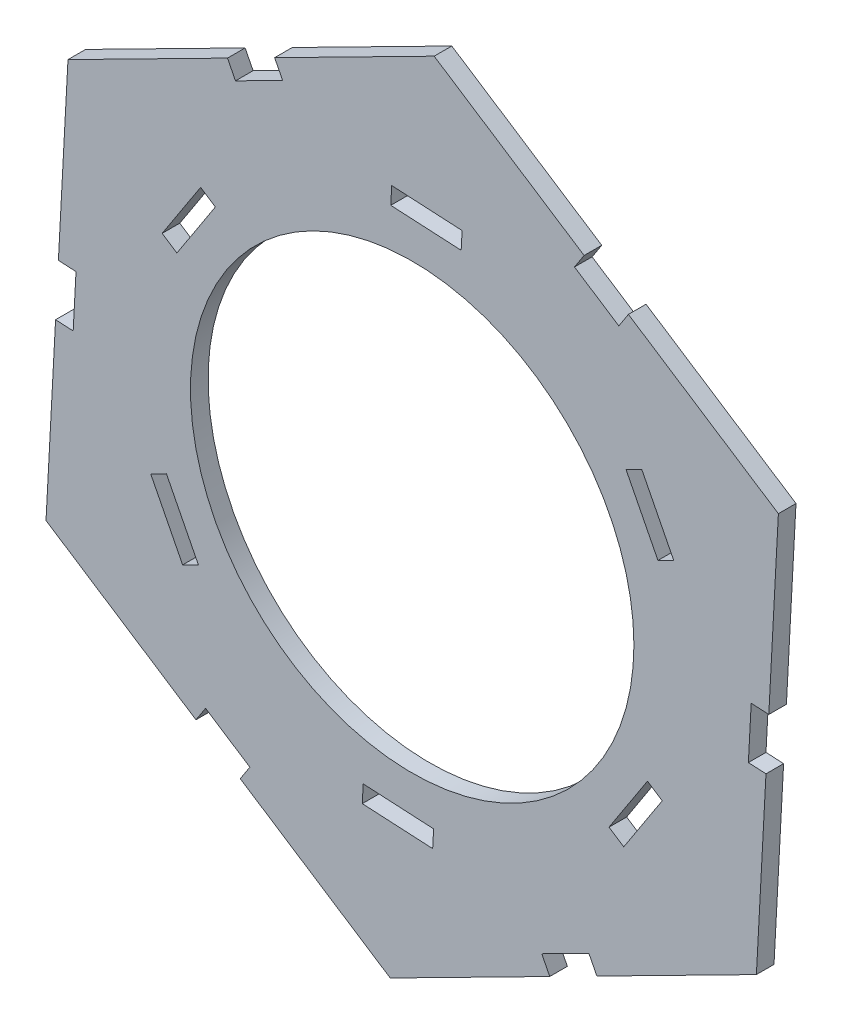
ISO-10303-21;
HEADER;
FILE_DESCRIPTION(('STEP AP214'),'2;1');
FILE_NAME('part.step','',(''),(''),'','','');
FILE_SCHEMA(('AUTOMOTIVE_DESIGN { 1 0 10303 214 1 1 1 1 }'));
ENDSEC;
DATA;
#1=APPLICATION_CONTEXT('core data for automotive mechanical design processes');
#2=APPLICATION_PROTOCOL_DEFINITION('international standard','automotive_design',2000,#1);
#3=PRODUCT_CONTEXT('',#1,'mechanical');
#4=PRODUCT('Part','Part','',(#3));
#5=PRODUCT_RELATED_PRODUCT_CATEGORY('part','',(#4));
#6=PRODUCT_DEFINITION_FORMATION('','',#4);
#7=PRODUCT_DEFINITION_CONTEXT('part definition',#1,'design');
#8=PRODUCT_DEFINITION('design','',#6,#7);
#9=PRODUCT_DEFINITION_SHAPE('','',#8);
#10=(LENGTH_UNIT() NAMED_UNIT(*) SI_UNIT(.MILLI.,.METRE.));
#11=(NAMED_UNIT(*) PLANE_ANGLE_UNIT() SI_UNIT($,.RADIAN.));
#12=(NAMED_UNIT(*) SI_UNIT($,.STERADIAN.) SOLID_ANGLE_UNIT());
#13=UNCERTAINTY_MEASURE_WITH_UNIT(LENGTH_MEASURE(1.E-05),#10,'distance_accuracy_value','');
#14=(GEOMETRIC_REPRESENTATION_CONTEXT(3) GLOBAL_UNCERTAINTY_ASSIGNED_CONTEXT((#13)) GLOBAL_UNIT_ASSIGNED_CONTEXT((#10,
#11,#12)) REPRESENTATION_CONTEXT('',''));
#15=CARTESIAN_POINT('',(0.,0.,0.));
#16=DIRECTION('',(0.,0.,1.));
#17=DIRECTION('',(1.,0.,0.));
#18=AXIS2_PLACEMENT_3D('',#15,#16,#17);
#19=CARTESIAN_POINT('',(57.7650823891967,-3.09490633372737,1.524));
#20=DIRECTION('',(0.998567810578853,-0.0535007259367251,0.));
#21=DIRECTION('',(0.0535007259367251,0.998567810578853,0.));
#22=AXIS2_PLACEMENT_3D('',#19,#20,#21);
#23=PLANE('',#22);
#24=DIRECTION('',(-0.0535007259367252,-0.998567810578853,0.));
#25=VECTOR('',#24,1.);
#26=CARTESIAN_POINT('',(57.7650823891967,-3.09490633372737,0.));
#27=LINE('',#26,#25);
#28=CARTESIAN_POINT('',(57.6927472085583,-4.44501106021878,0.));
#29=VERTEX_POINT('',#28);
#30=CARTESIAN_POINT('',(56.8649975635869,-19.8945986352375,0.));
#31=VERTEX_POINT('',#30);
#32=EDGE_CURVE('E470',#29,#31,#27,.T.);
#33=ORIENTED_EDGE('',*,*,#32,.T.);
#34=DIRECTION('',(0.,0.,-1.));
#35=VECTOR('',#34,1.);
#36=CARTESIAN_POINT('',(56.8649975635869,-19.8945986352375,1.524));
#37=LINE('',#36,#35);
#38=CARTESIAN_POINT('',(56.8649975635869,-19.8945986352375,1.524));
#39=VERTEX_POINT('',#38);
#40=EDGE_CURVE('E11',#39,#31,#37,.T.);
#41=ORIENTED_EDGE('',*,*,#40,.F.);
#42=DIRECTION('',(-0.0535007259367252,-0.998567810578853,0.));
#43=VECTOR('',#42,1.);
#44=CARTESIAN_POINT('',(57.7650823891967,-3.09490633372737,1.524));
#45=LINE('',#44,#43);
#46=CARTESIAN_POINT('',(57.6927472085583,-4.44501106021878,1.524));
#47=VERTEX_POINT('',#46);
#48=EDGE_CURVE('E744',#47,#39,#45,.T.);
#49=ORIENTED_EDGE('',*,*,#48,.F.);
#50=DIRECTION('',(0.,0.,-1.));
#51=VECTOR('',#50,1.);
#52=CARTESIAN_POINT('',(57.6927472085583,-4.44501106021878,1.524));
#53=LINE('',#52,#51);
#54=EDGE_CURVE('E55',#47,#29,#53,.T.);
#55=ORIENTED_EDGE('',*,*,#54,.T.);
#56=EDGE_LOOP('',(#33,#41,#49,#55));
#57=FACE_BOUND('',#56,.T.);
#58=ADVANCED_FACE('F36',(#57),#23,.F.);
#59=CARTESIAN_POINT('',(7.8318605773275,12.0292667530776,1.524));
#60=DIRECTION('',(0.545616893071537,0.838034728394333,0.));
#61=DIRECTION('',(-0.838034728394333,0.545616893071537,0.));
#62=AXIS2_PLACEMENT_3D('',#59,#60,#61);
#63=PLANE('',#62);
#64=DIRECTION('',(0.838034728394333,-0.545616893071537,0.));
#65=VECTOR('',#64,1.);
#66=CARTESIAN_POINT('',(7.8318605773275,12.0292667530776,0.));
#67=LINE('',#66,#65);
#68=CARTESIAN_POINT('',(69.8308580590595,-28.3362446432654,0.));
#69=VERTEX_POINT('',#68);
#70=EDGE_CURVE('E472',#31,#69,#67,.T.);
#71=ORIENTED_EDGE('',*,*,#70,.T.);
#72=DIRECTION('',(0.,0.,-1.));
#73=VECTOR('',#72,1.);
#74=CARTESIAN_POINT('',(69.8308580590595,-28.3362446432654,1.524));
#75=LINE('',#74,#73);
#76=CARTESIAN_POINT('',(69.8308580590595,-28.3362446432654,1.524));
#77=VERTEX_POINT('',#76);
#78=EDGE_CURVE('E46',#77,#69,#75,.T.);
#79=ORIENTED_EDGE('',*,*,#78,.F.);
#80=DIRECTION('',(0.838034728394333,-0.545616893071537,0.));
#81=VECTOR('',#80,1.);
#82=CARTESIAN_POINT('',(7.8318605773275,12.0292667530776,1.524));
#83=LINE('',#82,#81);
#84=EDGE_CURVE('E746',#39,#77,#83,.T.);
#85=ORIENTED_EDGE('',*,*,#84,.F.);
#86=ORIENTED_EDGE('',*,*,#40,.T.);
#87=EDGE_LOOP('',(#71,#79,#85,#86));
#88=FACE_BOUND('',#87,.T.);
#89=ADVANCED_FACE('F830',(#88),#63,.F.);
#90=CARTESIAN_POINT('',(61.9989974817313,-40.3655113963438,1.524));
#91=DIRECTION('',(-0.838034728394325,0.545616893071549,0.));
#92=DIRECTION('',(-0.545616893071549,-0.838034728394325,0.));
#93=AXIS2_PLACEMENT_3D('',#90,#91,#92);
#94=PLANE('',#93);
#95=DIRECTION('',(0.545616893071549,0.838034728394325,0.));
#96=VECTOR('',#95,1.);
#97=CARTESIAN_POINT('',(61.9989974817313,-40.3655113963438,0.));
#98=LINE('',#97,#96);
#99=CARTESIAN_POINT('',(70.6623782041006,-27.0590797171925,0.));
#100=VERTEX_POINT('',#99);
#101=EDGE_CURVE('E474',#69,#100,#98,.T.);
#102=ORIENTED_EDGE('',*,*,#101,.T.);
#103=DIRECTION('',(0.,0.,-1.));
#104=VECTOR('',#103,1.);
#105=CARTESIAN_POINT('',(70.6623782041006,-27.0590797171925,1.524));
#106=LINE('',#105,#104);
#107=CARTESIAN_POINT('',(70.6623782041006,-27.0590797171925,1.524));
#108=VERTEX_POINT('',#107);
#109=EDGE_CURVE('E605',#108,#100,#106,.T.);
#110=ORIENTED_EDGE('',*,*,#109,.F.);
#111=DIRECTION('',(0.545616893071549,0.838034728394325,0.));
#112=VECTOR('',#111,1.);
#113=CARTESIAN_POINT('',(61.9989974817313,-40.3655113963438,1.524));
#114=LINE('',#113,#112);
#115=EDGE_CURVE('E748',#77,#108,#114,.T.);
#116=ORIENTED_EDGE('',*,*,#115,.F.);
#117=ORIENTED_EDGE('',*,*,#78,.T.);
#118=EDGE_LOOP('',(#102,#110,#116,#117));
#119=FACE_BOUND('',#118,.T.);
#120=ADVANCED_FACE('F835',(#119),#94,.F.);
#121=CARTESIAN_POINT('',(8.66338072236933,13.3064316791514,1.524));
#122=DIRECTION('',(-0.545616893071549,-0.838034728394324,0.));
#123=DIRECTION('',(0.838034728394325,-0.54561689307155,0.));
#124=AXIS2_PLACEMENT_3D('',#121,#122,#123);
#125=PLANE('',#124);
#126=DIRECTION('',(-0.838034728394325,0.54561689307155,0.));
#127=VECTOR('',#126,1.);
#128=CARTESIAN_POINT('',(8.66338072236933,13.3064316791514,0.));
#129=LINE('',#128,#127);
#130=CARTESIAN_POINT('',(74.4938729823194,-29.5536401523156,0.));
#131=VERTEX_POINT('',#130);
#132=EDGE_CURVE('E477',#131,#100,#129,.T.);
#133=ORIENTED_EDGE('',*,*,#132,.F.);
#134=DIRECTION('',(0.,0.,-1.));
#135=VECTOR('',#134,1.);
#136=CARTESIAN_POINT('',(74.4938729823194,-29.5536401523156,1.524));
#137=LINE('',#136,#135);
#138=CARTESIAN_POINT('',(74.4938729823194,-29.5536401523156,1.524));
#139=VERTEX_POINT('',#138);
#140=EDGE_CURVE('E603',#139,#131,#137,.T.);
#141=ORIENTED_EDGE('',*,*,#140,.F.);
#142=DIRECTION('',(-0.838034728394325,0.54561689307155,0.));
#143=VECTOR('',#142,1.);
#144=CARTESIAN_POINT('',(8.66338072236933,13.3064316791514,1.524));
#145=LINE('',#144,#143);
#146=EDGE_CURVE('E750',#139,#108,#145,.T.);
#147=ORIENTED_EDGE('',*,*,#146,.T.);
#148=ORIENTED_EDGE('',*,*,#109,.T.);
#149=EDGE_LOOP('',(#133,#141,#147,#148));
#150=FACE_BOUND('',#149,.T.);
#151=ADVANCED_FACE('F1176',(#150),#125,.T.);
#152=CARTESIAN_POINT('',(65.8304922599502,-42.8600718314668,1.524));
#153=DIRECTION('',(-0.838034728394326,0.545616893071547,0.));
#154=DIRECTION('',(-0.545616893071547,-0.838034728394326,0.));
#155=AXIS2_PLACEMENT_3D('',#152,#153,#154);
#156=PLANE('',#155);
#157=DIRECTION('',(0.545616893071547,0.838034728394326,0.));
#158=VECTOR('',#157,1.);
#159=CARTESIAN_POINT('',(65.8304922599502,-42.8600718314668,0.));
#160=LINE('',#159,#158);
#161=CARTESIAN_POINT('',(73.6623528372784,-30.8308050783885,0.));
#162=VERTEX_POINT('',#161);
#163=EDGE_CURVE('E480',#162,#131,#160,.T.);
#164=ORIENTED_EDGE('',*,*,#163,.F.);
#165=DIRECTION('',(0.,0.,-1.));
#166=VECTOR('',#165,1.);
#167=CARTESIAN_POINT('',(73.6623528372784,-30.8308050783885,1.524));
#168=LINE('',#167,#166);
#169=CARTESIAN_POINT('',(73.6623528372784,-30.8308050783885,1.524));
#170=VERTEX_POINT('',#169);
#171=EDGE_CURVE('E601',#170,#162,#168,.T.);
#172=ORIENTED_EDGE('',*,*,#171,.F.);
#173=DIRECTION('',(0.545616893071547,0.838034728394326,0.));
#174=VECTOR('',#173,1.);
#175=CARTESIAN_POINT('',(65.8304922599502,-42.8600718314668,1.524));
#176=LINE('',#175,#174);
#177=EDGE_CURVE('E753',#170,#139,#176,.T.);
#178=ORIENTED_EDGE('',*,*,#177,.T.);
#179=ORIENTED_EDGE('',*,*,#140,.T.);
#180=EDGE_LOOP('',(#164,#172,#178,#179));
#181=FACE_BOUND('',#180,.T.);
#182=ADVANCED_FACE('F1168',(#181),#156,.T.);
#183=CARTESIAN_POINT('',(7.83186057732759,12.0292667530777,1.524));
#184=DIRECTION('',(0.545616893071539,0.838034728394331,0.));
#185=DIRECTION('',(-0.838034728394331,0.545616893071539,0.));
#186=AXIS2_PLACEMENT_3D('',#183,#184,#185);
#187=PLANE('',#186);
#188=DIRECTION('',(0.838034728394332,-0.545616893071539,0.));
#189=VECTOR('',#188,1.);
#190=CARTESIAN_POINT('',(7.83186057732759,12.0292667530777,0.));
#191=LINE('',#190,#189);
#192=CARTESIAN_POINT('',(86.6282133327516,-39.2724510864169,0.));
#193=VERTEX_POINT('',#192);
#194=EDGE_CURVE('E483',#162,#193,#191,.T.);
#195=ORIENTED_EDGE('',*,*,#194,.T.);
#196=DIRECTION('',(0.,0.,-1.));
#197=VECTOR('',#196,1.);
#198=CARTESIAN_POINT('',(86.6282133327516,-39.2724510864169,1.524));
#199=LINE('',#198,#197);
#200=CARTESIAN_POINT('',(86.6282133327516,-39.2724510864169,1.524));
#201=VERTEX_POINT('',#200);
#202=EDGE_CURVE('E598',#201,#193,#199,.T.);
#203=ORIENTED_EDGE('',*,*,#202,.F.);
#204=DIRECTION('',(0.838034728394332,-0.545616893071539,0.));
#205=VECTOR('',#204,1.);
#206=CARTESIAN_POINT('',(7.83186057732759,12.0292667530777,1.524));
#207=LINE('',#206,#205);
#208=EDGE_CURVE('E756',#170,#201,#207,.T.);
#209=ORIENTED_EDGE('',*,*,#208,.F.);
#210=ORIENTED_EDGE('',*,*,#171,.T.);
#211=EDGE_LOOP('',(#195,#203,#209,#210));
#212=FACE_BOUND('',#211,.T.);
#213=ADVANCED_FACE('F1160',(#212),#187,.F.);
#214=CARTESIAN_POINT('',(33.6321089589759,-66.1974981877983,1.524));
#215=DIRECTION('',(-0.452950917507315,0.891535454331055,0.));
#216=DIRECTION('',(-0.891535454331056,-0.452950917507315,0.));
#217=AXIS2_PLACEMENT_3D('',#214,#215,#216);
#218=PLANE('',#217);
#219=DIRECTION('',(0.891535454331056,0.452950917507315,0.));
#220=VECTOR('',#219,1.);
#221=CARTESIAN_POINT('',(33.6321089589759,-66.1974981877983,0.));
#222=LINE('',#221,#220);
#223=CARTESIAN_POINT('',(100.421823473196,-32.2645095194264,0.));
#224=VERTEX_POINT('',#223);
#225=EDGE_CURVE('E485',#193,#224,#222,.T.);
#226=ORIENTED_EDGE('',*,*,#225,.T.);
#227=DIRECTION('',(0.,0.,-1.));
#228=VECTOR('',#227,1.);
#229=CARTESIAN_POINT('',(100.421823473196,-32.2645095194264,1.524));
#230=LINE('',#229,#228);
#231=CARTESIAN_POINT('',(100.421823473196,-32.2645095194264,1.524));
#232=VERTEX_POINT('',#231);
#233=EDGE_CURVE('E595',#232,#224,#230,.T.);
#234=ORIENTED_EDGE('',*,*,#233,.F.);
#235=DIRECTION('',(0.891535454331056,0.452950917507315,0.));
#236=VECTOR('',#235,1.);
#237=CARTESIAN_POINT('',(33.6321089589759,-66.1974981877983,1.524));
#238=LINE('',#237,#236);
#239=EDGE_CURVE('E758',#201,#232,#238,.T.);
#240=ORIENTED_EDGE('',*,*,#239,.F.);
#241=ORIENTED_EDGE('',*,*,#202,.T.);
#242=EDGE_LOOP('',(#226,#234,#240,#241));
#243=FACE_BOUND('',#242,.T.);
#244=ADVANCED_FACE('F1152',(#243),#218,.F.);
#245=CARTESIAN_POINT('',(66.7897145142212,33.9329886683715,1.524));
#246=DIRECTION('',(-0.891535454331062,-0.452950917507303,0.));
#247=DIRECTION('',(0.452950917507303,-0.891535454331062,0.));
#248=AXIS2_PLACEMENT_3D('',#245,#246,#247);
#249=PLANE('',#248);
#250=DIRECTION('',(-0.452950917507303,0.891535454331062,0.));
#251=VECTOR('',#250,1.);
#252=CARTESIAN_POINT('',(66.7897145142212,33.9329886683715,0.));
#253=LINE('',#252,#251);
#254=CARTESIAN_POINT('',(99.7315262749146,-30.9058094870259,0.));
#255=VERTEX_POINT('',#254);
#256=EDGE_CURVE('E487',#224,#255,#253,.T.);
#257=ORIENTED_EDGE('',*,*,#256,.T.);
#258=DIRECTION('',(0.,0.,-1.));
#259=VECTOR('',#258,1.);
#260=CARTESIAN_POINT('',(99.7315262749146,-30.9058094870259,1.524));
#261=LINE('',#260,#259);
#262=CARTESIAN_POINT('',(99.7315262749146,-30.9058094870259,1.524));
#263=VERTEX_POINT('',#262);
#264=EDGE_CURVE('E593',#263,#255,#261,.T.);
#265=ORIENTED_EDGE('',*,*,#264,.F.);
#266=DIRECTION('',(-0.452950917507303,0.891535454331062,0.));
#267=VECTOR('',#266,1.);
#268=CARTESIAN_POINT('',(66.7897145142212,33.9329886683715,1.524));
#269=LINE('',#268,#267);
#270=EDGE_CURVE('E760',#232,#263,#269,.T.);
#271=ORIENTED_EDGE('',*,*,#270,.F.);
#272=ORIENTED_EDGE('',*,*,#233,.T.);
#273=EDGE_LOOP('',(#257,#265,#271,#272));
#274=FACE_BOUND('',#273,.T.);
#275=ADVANCED_FACE('F1144',(#274),#249,.F.);
#276=CARTESIAN_POINT('',(32.9418117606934,-64.8387981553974,1.524));
#277=DIRECTION('',(0.452950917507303,-0.891535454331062,0.));
#278=DIRECTION('',(0.891535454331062,0.452950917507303,0.));
#279=AXIS2_PLACEMENT_3D('',#276,#277,#278);
#280=PLANE('',#279);
#281=DIRECTION('',(-0.891535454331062,-0.452950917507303,0.));
#282=VECTOR('',#281,1.);
#283=CARTESIAN_POINT('',(32.9418117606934,-64.8387981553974,0.));
#284=LINE('',#283,#282);
#285=CARTESIAN_POINT('',(103.807626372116,-28.8349178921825,0.));
#286=VERTEX_POINT('',#285);
#287=EDGE_CURVE('E490',#286,#255,#284,.T.);
#288=ORIENTED_EDGE('',*,*,#287,.F.);
#289=DIRECTION('',(0.,0.,-1.));
#290=VECTOR('',#289,1.);
#291=CARTESIAN_POINT('',(103.807626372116,-28.8349178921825,1.524));
#292=LINE('',#291,#290);
#293=CARTESIAN_POINT('',(103.807626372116,-28.8349178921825,1.524));
#294=VERTEX_POINT('',#293);
#295=EDGE_CURVE('E591',#294,#286,#292,.T.);
#296=ORIENTED_EDGE('',*,*,#295,.F.);
#297=DIRECTION('',(-0.891535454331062,-0.452950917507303,0.));
#298=VECTOR('',#297,1.);
#299=CARTESIAN_POINT('',(32.9418117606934,-64.8387981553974,1.524));
#300=LINE('',#299,#298);
#301=EDGE_CURVE('E762',#294,#263,#300,.T.);
#302=ORIENTED_EDGE('',*,*,#301,.T.);
#303=ORIENTED_EDGE('',*,*,#264,.T.);
#304=EDGE_LOOP('',(#288,#296,#302,#303));
#305=FACE_BOUND('',#304,.T.);
#306=ADVANCED_FACE('F1136',(#305),#280,.T.);
#307=CARTESIAN_POINT('',(70.8658146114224,36.003880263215,1.524));
#308=DIRECTION('',(-0.89153545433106,-0.452950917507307,0.));
#309=DIRECTION('',(0.452950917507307,-0.89153545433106,0.));
#310=AXIS2_PLACEMENT_3D('',#307,#308,#309);
#311=PLANE('',#310);
#312=DIRECTION('',(-0.452950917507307,0.89153545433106,0.));
#313=VECTOR('',#312,1.);
#314=CARTESIAN_POINT('',(70.8658146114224,36.003880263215,0.));
#315=LINE('',#314,#313);
#316=CARTESIAN_POINT('',(104.497923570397,-30.193617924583,0.));
#317=VERTEX_POINT('',#316);
#318=EDGE_CURVE('E493',#317,#286,#315,.T.);
#319=ORIENTED_EDGE('',*,*,#318,.F.);
#320=DIRECTION('',(0.,0.,-1.));
#321=VECTOR('',#320,1.);
#322=CARTESIAN_POINT('',(104.497923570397,-30.193617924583,1.524));
#323=LINE('',#322,#321);
#324=CARTESIAN_POINT('',(104.497923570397,-30.193617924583,1.524));
#325=VERTEX_POINT('',#324);
#326=EDGE_CURVE('E589',#325,#317,#323,.T.);
#327=ORIENTED_EDGE('',*,*,#326,.F.);
#328=DIRECTION('',(-0.452950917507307,0.89153545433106,0.));
#329=VECTOR('',#328,1.);
#330=CARTESIAN_POINT('',(70.8658146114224,36.003880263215,1.524));
#331=LINE('',#330,#329);
#332=EDGE_CURVE('E765',#325,#294,#331,.T.);
#333=ORIENTED_EDGE('',*,*,#332,.T.);
#334=ORIENTED_EDGE('',*,*,#295,.T.);
#335=EDGE_LOOP('',(#319,#327,#333,#334));
#336=FACE_BOUND('',#335,.T.);
#337=ADVANCED_FACE('F1128',(#336),#311,.T.);
#338=CARTESIAN_POINT('',(33.632108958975,-66.1974981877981,1.524));
#339=DIRECTION('',(-0.452950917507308,0.891535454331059,0.));
#340=DIRECTION('',(-0.891535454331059,-0.452950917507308,0.));
#341=AXIS2_PLACEMENT_3D('',#338,#339,#340);
#342=PLANE('',#341);
#343=DIRECTION('',(0.891535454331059,0.452950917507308,0.));
#344=VECTOR('',#343,1.);
#345=CARTESIAN_POINT('',(33.632108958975,-66.1974981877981,0.));
#346=LINE('',#345,#344);
#347=CARTESIAN_POINT('',(118.291533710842,-23.1856763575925,0.));
#348=VERTEX_POINT('',#347);
#349=EDGE_CURVE('E496',#317,#348,#346,.T.);
#350=ORIENTED_EDGE('',*,*,#349,.T.);
#351=DIRECTION('',(0.,0.,-1.));
#352=VECTOR('',#351,1.);
#353=CARTESIAN_POINT('',(118.291533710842,-23.1856763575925,1.524));
#354=LINE('',#353,#352);
#355=CARTESIAN_POINT('',(118.291533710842,-23.1856763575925,1.524));
#356=VERTEX_POINT('',#355);
#357=EDGE_CURVE('E586',#356,#348,#354,.T.);
#358=ORIENTED_EDGE('',*,*,#357,.F.);
#359=DIRECTION('',(0.891535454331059,0.452950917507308,0.));
#360=VECTOR('',#359,1.);
#361=CARTESIAN_POINT('',(33.632108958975,-66.1974981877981,1.524));
#362=LINE('',#361,#360);
#363=EDGE_CURVE('E768',#325,#356,#362,.T.);
#364=ORIENTED_EDGE('',*,*,#363,.F.);
#365=ORIENTED_EDGE('',*,*,#326,.T.);
#366=EDGE_LOOP('',(#350,#358,#364,#365));
#367=FACE_BOUND('',#366,.T.);
#368=ADVANCED_FACE('F1120',(#367),#342,.F.);
#369=CARTESIAN_POINT('',(119.191618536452,-6.38598405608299,1.524));
#370=DIRECTION('',(-0.998567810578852,0.0535007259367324,0.));
#371=DIRECTION('',(-0.0535007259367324,-0.998567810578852,0.));
#372=AXIS2_PLACEMENT_3D('',#369,#370,#371);
#373=PLANE('',#372);
#374=DIRECTION('',(0.0535007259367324,0.998567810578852,0.));
#375=VECTOR('',#374,1.);
#376=CARTESIAN_POINT('',(119.191618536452,-6.38598405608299,0.));
#377=LINE('',#376,#375);
#378=CARTESIAN_POINT('',(119.119283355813,-7.73608878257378,0.));
#379=VERTEX_POINT('',#378);
#380=EDGE_CURVE('E498',#348,#379,#377,.T.);
#381=ORIENTED_EDGE('',*,*,#380,.T.);
#382=DIRECTION('',(0.,0.,-1.));
#383=VECTOR('',#382,1.);
#384=CARTESIAN_POINT('',(119.119283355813,-7.73608878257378,1.524));
#385=LINE('',#384,#383);
#386=CARTESIAN_POINT('',(119.119283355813,-7.73608878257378,1.524));
#387=VERTEX_POINT('',#386);
#388=EDGE_CURVE('E583',#387,#379,#385,.T.);
#389=ORIENTED_EDGE('',*,*,#388,.F.);
#390=DIRECTION('',(0.0535007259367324,0.998567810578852,0.));
#391=VECTOR('',#390,1.);
#392=CARTESIAN_POINT('',(119.191618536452,-6.38598405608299,1.524));
#393=LINE('',#392,#391);
#394=EDGE_CURVE('E770',#356,#387,#393,.T.);
#395=ORIENTED_EDGE('',*,*,#394,.F.);
#396=ORIENTED_EDGE('',*,*,#357,.T.);
#397=EDGE_LOOP('',(#381,#389,#395,#396));
#398=FACE_BOUND('',#397,.T.);
#399=ADVANCED_FACE('F1112',(#398),#373,.F.);
#400=CARTESIAN_POINT('',(-0.0723351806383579,-1.35010472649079,1.524));
#401=DIRECTION('',(-0.0535007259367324,-0.998567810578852,0.));
#402=DIRECTION('',(0.998567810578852,-0.0535007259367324,0.));
#403=AXIS2_PLACEMENT_3D('',#400,#401,#402);
#404=PLANE('',#403);
#405=DIRECTION('',(-0.998567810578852,0.0535007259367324,0.));
#406=VECTOR('',#405,1.);
#407=CARTESIAN_POINT('',(-0.0723351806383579,-1.35010472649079,0.));
#408=LINE('',#407,#406);
#409=CARTESIAN_POINT('',(117.597466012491,-7.6545536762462,0.));
#410=VERTEX_POINT('',#409);
#411=EDGE_CURVE('E500',#379,#410,#408,.T.);
#412=ORIENTED_EDGE('',*,*,#411,.T.);
#413=DIRECTION('',(0.,0.,-1.));
#414=VECTOR('',#413,1.);
#415=CARTESIAN_POINT('',(117.597466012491,-7.6545536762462,1.524));
#416=LINE('',#415,#414);
#417=CARTESIAN_POINT('',(117.597466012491,-7.6545536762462,1.524));
#418=VERTEX_POINT('',#417);
#419=EDGE_CURVE('E581',#418,#410,#416,.T.);
#420=ORIENTED_EDGE('',*,*,#419,.F.);
#421=DIRECTION('',(-0.998567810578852,0.0535007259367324,0.));
#422=VECTOR('',#421,1.);
#423=CARTESIAN_POINT('',(-0.0723351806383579,-1.35010472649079,1.524));
#424=LINE('',#423,#422);
#425=EDGE_CURVE('E772',#387,#418,#424,.T.);
#426=ORIENTED_EDGE('',*,*,#425,.F.);
#427=ORIENTED_EDGE('',*,*,#388,.T.);
#428=EDGE_LOOP('',(#412,#420,#426,#427));
#429=FACE_BOUND('',#428,.T.);
#430=ADVANCED_FACE('F1104',(#429),#404,.F.);
#431=CARTESIAN_POINT('',(117.669801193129,-6.30444894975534,1.524));
#432=DIRECTION('',(0.998567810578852,-0.0535007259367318,0.));
#433=DIRECTION('',(0.0535007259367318,0.998567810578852,0.));
#434=AXIS2_PLACEMENT_3D('',#431,#432,#433);
#435=PLANE('',#434);
#436=DIRECTION('',(-0.0535007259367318,-0.998567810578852,0.));
#437=VECTOR('',#436,1.);
#438=CARTESIAN_POINT('',(117.669801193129,-6.30444894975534,0.));
#439=LINE('',#438,#437);
#440=CARTESIAN_POINT('',(117.842071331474,-3.08910164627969,0.));
#441=VERTEX_POINT('',#440);
#442=EDGE_CURVE('E503',#441,#410,#439,.T.);
#443=ORIENTED_EDGE('',*,*,#442,.F.);
#444=DIRECTION('',(0.,0.,-1.));
#445=VECTOR('',#444,1.);
#446=CARTESIAN_POINT('',(117.842071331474,-3.08910164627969,1.524));
#447=LINE('',#446,#445);
#448=CARTESIAN_POINT('',(117.842071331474,-3.08910164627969,1.524));
#449=VERTEX_POINT('',#448);
#450=EDGE_CURVE('E579',#449,#441,#447,.T.);
#451=ORIENTED_EDGE('',*,*,#450,.F.);
#452=DIRECTION('',(-0.0535007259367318,-0.998567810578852,0.));
#453=VECTOR('',#452,1.);
#454=CARTESIAN_POINT('',(117.669801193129,-6.30444894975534,1.524));
#455=LINE('',#454,#453);
#456=EDGE_CURVE('E774',#449,#418,#455,.T.);
#457=ORIENTED_EDGE('',*,*,#456,.T.);
#458=ORIENTED_EDGE('',*,*,#419,.T.);
#459=EDGE_LOOP('',(#443,#451,#457,#458));
#460=FACE_BOUND('',#459,.T.);
#461=ADVANCED_FACE('F1096',(#460),#435,.T.);
#462=CARTESIAN_POINT('',(0.172270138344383,3.21534730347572,1.524));
#463=DIRECTION('',(-0.0535007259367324,-0.998567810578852,0.));
#464=DIRECTION('',(0.998567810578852,-0.0535007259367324,0.));
#465=AXIS2_PLACEMENT_3D('',#462,#463,#464);
#466=PLANE('',#465);
#467=DIRECTION('',(-0.998567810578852,0.0535007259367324,0.));
#468=VECTOR('',#467,1.);
#469=CARTESIAN_POINT('',(0.172270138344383,3.21534730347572,0.));
#470=LINE('',#469,#468);
#471=CARTESIAN_POINT('',(119.363888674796,-3.17063675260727,0.));
#472=VERTEX_POINT('',#471);
#473=EDGE_CURVE('E506',#472,#441,#470,.T.);
#474=ORIENTED_EDGE('',*,*,#473,.F.);
#475=DIRECTION('',(0.,0.,-1.));
#476=VECTOR('',#475,1.);
#477=CARTESIAN_POINT('',(119.363888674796,-3.17063675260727,1.524));
#478=LINE('',#477,#476);
#479=CARTESIAN_POINT('',(119.363888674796,-3.17063675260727,1.524));
#480=VERTEX_POINT('',#479);
#481=EDGE_CURVE('E577',#480,#472,#478,.T.);
#482=ORIENTED_EDGE('',*,*,#481,.F.);
#483=DIRECTION('',(-0.998567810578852,0.0535007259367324,0.));
#484=VECTOR('',#483,1.);
#485=CARTESIAN_POINT('',(0.172270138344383,3.21534730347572,1.524));
#486=LINE('',#485,#484);
#487=EDGE_CURVE('E777',#480,#449,#486,.T.);
#488=ORIENTED_EDGE('',*,*,#487,.T.);
#489=ORIENTED_EDGE('',*,*,#450,.T.);
#490=EDGE_LOOP('',(#474,#482,#488,#489));
#491=FACE_BOUND('',#490,.T.);
#492=ADVANCED_FACE('F1088',(#491),#466,.T.);
#493=CARTESIAN_POINT('',(119.191618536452,-6.38598405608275,1.524));
#494=DIRECTION('',(-0.998567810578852,0.0535007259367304,0.));
#495=DIRECTION('',(-0.0535007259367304,-0.998567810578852,0.));
#496=AXIS2_PLACEMENT_3D('',#493,#494,#495);
#497=PLANE('',#496);
#498=DIRECTION('',(0.0535007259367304,0.998567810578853,0.));
#499=VECTOR('',#498,1.);
#500=CARTESIAN_POINT('',(119.191618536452,-6.38598405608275,0.));
#501=LINE('',#500,#499);
#502=CARTESIAN_POINT('',(120.191638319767,12.2789508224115,0.));
#503=VERTEX_POINT('',#502);
#504=EDGE_CURVE('E509',#472,#503,#501,.T.);
#505=ORIENTED_EDGE('',*,*,#504,.T.);
#506=DIRECTION('',(0.,0.,-1.));
#507=VECTOR('',#506,1.);
#508=CARTESIAN_POINT('',(120.191638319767,12.2789508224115,1.524));
#509=LINE('',#508,#507);
#510=CARTESIAN_POINT('',(120.191638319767,12.2789508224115,1.524));
#511=VERTEX_POINT('',#510);
#512=EDGE_CURVE('E574',#511,#503,#509,.T.);
#513=ORIENTED_EDGE('',*,*,#512,.F.);
#514=DIRECTION('',(0.0535007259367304,0.998567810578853,0.));
#515=VECTOR('',#514,1.);
#516=CARTESIAN_POINT('',(119.191618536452,-6.38598405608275,1.524));
#517=LINE('',#516,#515);
#518=EDGE_CURVE('E780',#480,#511,#517,.T.);
#519=ORIENTED_EDGE('',*,*,#518,.F.);
#520=ORIENTED_EDGE('',*,*,#481,.T.);
#521=EDGE_LOOP('',(#505,#513,#519,#520));
#522=FACE_BOUND('',#521,.T.);
#523=ADVANCED_FACE('F1080',(#522),#497,.F.);
#524=CARTESIAN_POINT('',(41.3952855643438,63.5806686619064,1.524));
#525=DIRECTION('',(-0.545616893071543,-0.838034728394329,0.));
#526=DIRECTION('',(0.838034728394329,-0.545616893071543,0.));
#527=AXIS2_PLACEMENT_3D('',#524,#525,#526);
#528=PLANE('',#527);
#529=DIRECTION('',(-0.838034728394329,0.545616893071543,0.));
#530=VECTOR('',#529,1.);
#531=CARTESIAN_POINT('',(41.3952855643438,63.5806686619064,0.));
#532=LINE('',#531,#530);
#533=CARTESIAN_POINT('',(107.225777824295,20.7205968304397,0.));
#534=VERTEX_POINT('',#533);
#535=EDGE_CURVE('E511',#503,#534,#532,.T.);
#536=ORIENTED_EDGE('',*,*,#535,.T.);
#537=DIRECTION('',(0.,0.,-1.));
#538=VECTOR('',#537,1.);
#539=CARTESIAN_POINT('',(107.225777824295,20.7205968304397,1.524));
#540=LINE('',#539,#538);
#541=CARTESIAN_POINT('',(107.225777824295,20.7205968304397,1.524));
#542=VERTEX_POINT('',#541);
#543=EDGE_CURVE('E571',#542,#534,#540,.T.);
#544=ORIENTED_EDGE('',*,*,#543,.F.);
#545=DIRECTION('',(-0.838034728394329,0.545616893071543,0.));
#546=VECTOR('',#545,1.);
#547=CARTESIAN_POINT('',(41.3952855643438,63.5806686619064,1.524));
#548=LINE('',#547,#546);
#549=EDGE_CURVE('E782',#511,#542,#548,.T.);
#550=ORIENTED_EDGE('',*,*,#549,.F.);
#551=ORIENTED_EDGE('',*,*,#512,.T.);
#552=EDGE_LOOP('',(#536,#544,#550,#551));
#553=FACE_BOUND('',#552,.T.);
#554=ADVANCED_FACE('F1072',(#553),#528,.F.);
#555=CARTESIAN_POINT('',(65.830492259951,-42.8600718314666,1.524));
#556=DIRECTION('',(0.83803472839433,-0.545616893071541,0.));
#557=DIRECTION('',(0.545616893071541,0.83803472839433,0.));
#558=AXIS2_PLACEMENT_3D('',#555,#556,#557);
#559=PLANE('',#558);
#560=DIRECTION('',(-0.545616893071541,-0.83803472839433,0.));
#561=VECTOR('',#560,1.);
#562=CARTESIAN_POINT('',(65.830492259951,-42.8600718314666,0.));
#563=LINE('',#562,#561);
#564=CARTESIAN_POINT('',(106.394257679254,19.4434319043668,0.));
#565=VERTEX_POINT('',#564);
#566=EDGE_CURVE('E513',#534,#565,#563,.T.);
#567=ORIENTED_EDGE('',*,*,#566,.T.);
#568=DIRECTION('',(0.,0.,-1.));
#569=VECTOR('',#568,1.);
#570=CARTESIAN_POINT('',(106.394257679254,19.4434319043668,1.524));
#571=LINE('',#570,#569);
#572=CARTESIAN_POINT('',(106.394257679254,19.4434319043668,1.524));
#573=VERTEX_POINT('',#572);
#574=EDGE_CURVE('E569',#573,#565,#571,.T.);
#575=ORIENTED_EDGE('',*,*,#574,.F.);
#576=DIRECTION('',(-0.545616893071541,-0.83803472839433,0.));
#577=VECTOR('',#576,1.);
#578=CARTESIAN_POINT('',(65.830492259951,-42.8600718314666,1.524));
#579=LINE('',#578,#577);
#580=EDGE_CURVE('E784',#542,#573,#579,.T.);
#581=ORIENTED_EDGE('',*,*,#580,.F.);
#582=ORIENTED_EDGE('',*,*,#543,.T.);
#583=EDGE_LOOP('',(#567,#575,#581,#582));
#584=FACE_BOUND('',#583,.T.);
#585=ADVANCED_FACE('F1064',(#584),#559,.F.);
#586=CARTESIAN_POINT('',(40.5637654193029,62.3035037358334,1.524));
#587=DIRECTION('',(0.545616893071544,0.838034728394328,0.));
#588=DIRECTION('',(-0.838034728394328,0.545616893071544,0.));
#589=AXIS2_PLACEMENT_3D('',#586,#587,#588);
#590=PLANE('',#589);
#591=DIRECTION('',(0.838034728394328,-0.545616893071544,0.));
#592=VECTOR('',#591,1.);
#593=CARTESIAN_POINT('',(40.5637654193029,62.3035037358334,0.));
#594=LINE('',#593,#592);
#595=CARTESIAN_POINT('',(102.562762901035,21.9379923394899,0.));
#596=VERTEX_POINT('',#595);
#597=EDGE_CURVE('E516',#596,#565,#594,.T.);
#598=ORIENTED_EDGE('',*,*,#597,.F.);
#599=DIRECTION('',(0.,0.,-1.));
#600=VECTOR('',#599,1.);
#601=CARTESIAN_POINT('',(102.562762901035,21.9379923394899,1.524));
#602=LINE('',#601,#600);
#603=CARTESIAN_POINT('',(102.562762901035,21.9379923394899,1.524));
#604=VERTEX_POINT('',#603);
#605=EDGE_CURVE('E567',#604,#596,#602,.T.);
#606=ORIENTED_EDGE('',*,*,#605,.F.);
#607=DIRECTION('',(0.838034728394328,-0.545616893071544,0.));
#608=VECTOR('',#607,1.);
#609=CARTESIAN_POINT('',(40.5637654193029,62.3035037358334,1.524));
#610=LINE('',#609,#608);
#611=EDGE_CURVE('E786',#604,#573,#610,.T.);
#612=ORIENTED_EDGE('',*,*,#611,.T.);
#613=ORIENTED_EDGE('',*,*,#574,.T.);
#614=EDGE_LOOP('',(#598,#606,#612,#613));
#615=FACE_BOUND('',#614,.T.);
#616=ADVANCED_FACE('F1056',(#615),#590,.T.);
#617=CARTESIAN_POINT('',(61.9989974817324,-40.3655113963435,1.524));
#618=DIRECTION('',(0.838034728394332,-0.545616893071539,0.));
#619=DIRECTION('',(0.545616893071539,0.838034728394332,0.));
#620=AXIS2_PLACEMENT_3D('',#617,#618,#619);
#621=PLANE('',#620);
#622=DIRECTION('',(-0.545616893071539,-0.838034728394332,0.));
#623=VECTOR('',#622,1.);
#624=CARTESIAN_POINT('',(61.9989974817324,-40.3655113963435,0.));
#625=LINE('',#624,#623);
#626=CARTESIAN_POINT('',(103.394283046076,23.2151572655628,0.));
#627=VERTEX_POINT('',#626);
#628=EDGE_CURVE('E519',#627,#596,#625,.T.);
#629=ORIENTED_EDGE('',*,*,#628,.F.);
#630=DIRECTION('',(0.,0.,-1.));
#631=VECTOR('',#630,1.);
#632=CARTESIAN_POINT('',(103.394283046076,23.2151572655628,1.524));
#633=LINE('',#632,#631);
#634=CARTESIAN_POINT('',(103.394283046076,23.2151572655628,1.524));
#635=VERTEX_POINT('',#634);
#636=EDGE_CURVE('E565',#635,#627,#633,.T.);
#637=ORIENTED_EDGE('',*,*,#636,.F.);
#638=DIRECTION('',(-0.545616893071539,-0.838034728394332,0.));
#639=VECTOR('',#638,1.);
#640=CARTESIAN_POINT('',(61.9989974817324,-40.3655113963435,1.524));
#641=LINE('',#640,#639);
#642=EDGE_CURVE('E789',#635,#604,#641,.T.);
#643=ORIENTED_EDGE('',*,*,#642,.T.);
#644=ORIENTED_EDGE('',*,*,#605,.T.);
#645=EDGE_LOOP('',(#629,#637,#643,#644));
#646=FACE_BOUND('',#645,.T.);
#647=ADVANCED_FACE('F1048',(#646),#621,.T.);
#648=CARTESIAN_POINT('',(41.3952855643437,63.5806686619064,1.524));
#649=DIRECTION('',(-0.545616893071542,-0.838034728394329,0.));
#650=DIRECTION('',(0.83803472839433,-0.545616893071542,0.));
#651=AXIS2_PLACEMENT_3D('',#648,#649,#650);
#652=PLANE('',#651);
#653=DIRECTION('',(-0.83803472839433,0.545616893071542,0.));
#654=VECTOR('',#653,1.);
#655=CARTESIAN_POINT('',(41.3952855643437,63.5806686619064,0.));
#656=LINE('',#655,#654);
#657=CARTESIAN_POINT('',(90.4284225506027,31.656803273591,0.));
#658=VERTEX_POINT('',#657);
#659=EDGE_CURVE('E522',#627,#658,#656,.T.);
#660=ORIENTED_EDGE('',*,*,#659,.T.);
#661=DIRECTION('',(0.,0.,-1.));
#662=VECTOR('',#661,1.);
#663=CARTESIAN_POINT('',(90.4284225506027,31.656803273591,1.524));
#664=LINE('',#663,#662);
#665=CARTESIAN_POINT('',(90.4284225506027,31.656803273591,1.524));
#666=VERTEX_POINT('',#665);
#667=EDGE_CURVE('E562',#666,#658,#664,.T.);
#668=ORIENTED_EDGE('',*,*,#667,.F.);
#669=DIRECTION('',(-0.83803472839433,0.545616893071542,0.));
#670=VECTOR('',#669,1.);
#671=CARTESIAN_POINT('',(41.3952855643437,63.5806686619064,1.524));
#672=LINE('',#671,#670);
#673=EDGE_CURVE('E792',#635,#666,#672,.T.);
#674=ORIENTED_EDGE('',*,*,#673,.F.);
#675=ORIENTED_EDGE('',*,*,#636,.T.);
#676=EDGE_LOOP('',(#660,#668,#674,#675));
#677=FACE_BOUND('',#676,.T.);
#678=ADVANCED_FACE('F1040',(#677),#652,.F.);
#679=CARTESIAN_POINT('',(5.76899779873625,-11.3550185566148,1.524));
#680=DIRECTION('',(0.452950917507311,-0.891535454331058,0.));
#681=DIRECTION('',(0.891535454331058,0.452950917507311,0.));
#682=AXIS2_PLACEMENT_3D('',#679,#680,#681);
#683=PLANE('',#682);
#684=DIRECTION('',(-0.891535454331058,-0.452950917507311,0.));
#685=VECTOR('',#684,1.);
#686=CARTESIAN_POINT('',(5.76899779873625,-11.3550185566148,0.));
#687=LINE('',#686,#685);
#688=CARTESIAN_POINT('',(76.6348124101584,24.6488617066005,0.));
#689=VERTEX_POINT('',#688);
#690=EDGE_CURVE('E524',#658,#689,#687,.T.);
#691=ORIENTED_EDGE('',*,*,#690,.T.);
#692=DIRECTION('',(0.,0.,-1.));
#693=VECTOR('',#692,1.);
#694=CARTESIAN_POINT('',(76.6348124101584,24.6488617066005,1.524));
#695=LINE('',#694,#693);
#696=CARTESIAN_POINT('',(76.6348124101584,24.6488617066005,1.524));
#697=VERTEX_POINT('',#696);
#698=EDGE_CURVE('E559',#697,#689,#695,.T.);
#699=ORIENTED_EDGE('',*,*,#698,.F.);
#700=DIRECTION('',(-0.891535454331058,-0.452950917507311,0.));
#701=VECTOR('',#700,1.);
#702=CARTESIAN_POINT('',(5.76899779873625,-11.3550185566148,1.524));
#703=LINE('',#702,#701);
#704=EDGE_CURVE('E794',#666,#697,#703,.T.);
#705=ORIENTED_EDGE('',*,*,#704,.F.);
#706=ORIENTED_EDGE('',*,*,#667,.T.);
#707=EDGE_LOOP('',(#691,#699,#705,#706));
#708=FACE_BOUND('',#707,.T.);
#709=ADVANCED_FACE('F1032',(#708),#683,.F.);
#710=CARTESIAN_POINT('',(70.865814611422,36.0038802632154,1.524));
#711=DIRECTION('',(0.891535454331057,0.452950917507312,0.));
#712=DIRECTION('',(-0.452950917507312,0.891535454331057,0.));
#713=AXIS2_PLACEMENT_3D('',#710,#711,#712);
#714=PLANE('',#713);
#715=DIRECTION('',(0.452950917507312,-0.891535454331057,0.));
#716=VECTOR('',#715,1.);
#717=CARTESIAN_POINT('',(70.865814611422,36.0038802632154,0.));
#718=LINE('',#717,#716);
#719=CARTESIAN_POINT('',(77.3251096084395,23.2901616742,0.));
#720=VERTEX_POINT('',#719);
#721=EDGE_CURVE('E526',#689,#720,#718,.T.);
#722=ORIENTED_EDGE('',*,*,#721,.T.);
#723=DIRECTION('',(0.,0.,-1.));
#724=VECTOR('',#723,1.);
#725=CARTESIAN_POINT('',(77.3251096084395,23.2901616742,1.524));
#726=LINE('',#725,#724);
#727=CARTESIAN_POINT('',(77.3251096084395,23.2901616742,1.524));
#728=VERTEX_POINT('',#727);
#729=EDGE_CURVE('E557',#728,#720,#726,.T.);
#730=ORIENTED_EDGE('',*,*,#729,.F.);
#731=DIRECTION('',(0.452950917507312,-0.891535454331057,0.));
#732=VECTOR('',#731,1.);
#733=CARTESIAN_POINT('',(70.865814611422,36.0038802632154,1.524));
#734=LINE('',#733,#732);
#735=EDGE_CURVE('E796',#697,#728,#734,.T.);
#736=ORIENTED_EDGE('',*,*,#735,.F.);
#737=ORIENTED_EDGE('',*,*,#698,.T.);
#738=EDGE_LOOP('',(#722,#730,#736,#737));
#739=FACE_BOUND('',#738,.T.);
#740=ADVANCED_FACE('F1024',(#739),#714,.F.);
#741=CARTESIAN_POINT('',(6.4592949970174,-12.7137185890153,1.524));
#742=DIRECTION('',(-0.452950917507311,0.891535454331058,0.));
#743=DIRECTION('',(-0.891535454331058,-0.452950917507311,0.));
#744=AXIS2_PLACEMENT_3D('',#741,#742,#743);
#745=PLANE('',#744);
#746=DIRECTION('',(0.891535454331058,0.452950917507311,0.));
#747=VECTOR('',#746,1.);
#748=CARTESIAN_POINT('',(6.4592949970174,-12.7137185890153,0.));
#749=LINE('',#748,#747);
#750=CARTESIAN_POINT('',(73.2490095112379,21.2192700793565,0.));
#751=VERTEX_POINT('',#750);
#752=EDGE_CURVE('E529',#751,#720,#749,.T.);
#753=ORIENTED_EDGE('',*,*,#752,.F.);
#754=DIRECTION('',(0.,0.,-1.));
#755=VECTOR('',#754,1.);
#756=CARTESIAN_POINT('',(73.2490095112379,21.2192700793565,1.524));
#757=LINE('',#756,#755);
#758=CARTESIAN_POINT('',(73.2490095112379,21.2192700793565,1.524));
#759=VERTEX_POINT('',#758);
#760=EDGE_CURVE('E555',#759,#751,#757,.T.);
#761=ORIENTED_EDGE('',*,*,#760,.F.);
#762=DIRECTION('',(0.891535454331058,0.452950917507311,0.));
#763=VECTOR('',#762,1.);
#764=CARTESIAN_POINT('',(6.4592949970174,-12.7137185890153,1.524));
#765=LINE('',#764,#763);
#766=EDGE_CURVE('E798',#759,#728,#765,.T.);
#767=ORIENTED_EDGE('',*,*,#766,.T.);
#768=ORIENTED_EDGE('',*,*,#729,.T.);
#769=EDGE_LOOP('',(#753,#761,#767,#768));
#770=FACE_BOUND('',#769,.T.);
#771=ADVANCED_FACE('F1016',(#770),#745,.T.);
#772=CARTESIAN_POINT('',(66.7897145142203,33.9329886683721,1.524));
#773=DIRECTION('',(0.891535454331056,0.452950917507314,0.));
#774=DIRECTION('',(-0.452950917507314,0.891535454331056,0.));
#775=AXIS2_PLACEMENT_3D('',#772,#773,#774);
#776=PLANE('',#775);
#777=DIRECTION('',(0.452950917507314,-0.891535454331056,0.));
#778=VECTOR('',#777,1.);
#779=CARTESIAN_POINT('',(66.7897145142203,33.9329886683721,0.));
#780=LINE('',#779,#778);
#781=CARTESIAN_POINT('',(72.5587123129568,22.5779701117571,0.));
#782=VERTEX_POINT('',#781);
#783=EDGE_CURVE('E532',#782,#751,#780,.T.);
#784=ORIENTED_EDGE('',*,*,#783,.F.);
#785=DIRECTION('',(0.,0.,-1.));
#786=VECTOR('',#785,1.);
#787=CARTESIAN_POINT('',(72.5587123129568,22.5779701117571,1.524));
#788=LINE('',#787,#786);
#789=CARTESIAN_POINT('',(72.5587123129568,22.5779701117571,1.524));
#790=VERTEX_POINT('',#789);
#791=EDGE_CURVE('E553',#790,#782,#788,.T.);
#792=ORIENTED_EDGE('',*,*,#791,.F.);
#793=DIRECTION('',(0.452950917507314,-0.891535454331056,0.));
#794=VECTOR('',#793,1.);
#795=CARTESIAN_POINT('',(66.7897145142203,33.9329886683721,1.524));
#796=LINE('',#795,#794);
#797=EDGE_CURVE('E801',#790,#759,#796,.T.);
#798=ORIENTED_EDGE('',*,*,#797,.T.);
#799=ORIENTED_EDGE('',*,*,#760,.T.);
#800=EDGE_LOOP('',(#784,#792,#798,#799));
#801=FACE_BOUND('',#800,.T.);
#802=ADVANCED_FACE('F1009',(#801),#776,.T.);
#803=CARTESIAN_POINT('',(5.76899779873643,-11.355018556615,1.524));
#804=DIRECTION('',(0.452950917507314,-0.891535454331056,0.));
#805=DIRECTION('',(0.891535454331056,0.452950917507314,0.));
#806=AXIS2_PLACEMENT_3D('',#803,#804,#805);
#807=PLANE('',#806);
#808=DIRECTION('',(-0.891535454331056,-0.452950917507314,0.));
#809=VECTOR('',#808,1.);
#810=CARTESIAN_POINT('',(5.76899779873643,-11.355018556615,0.));
#811=LINE('',#810,#809);
#812=CARTESIAN_POINT('',(58.7651021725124,15.5700285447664,0.));
#813=VERTEX_POINT('',#812);
#814=EDGE_CURVE('E535',#782,#813,#811,.T.);
#815=ORIENTED_EDGE('',*,*,#814,.T.);
#816=DIRECTION('',(0.,0.,-1.));
#817=VECTOR('',#816,1.);
#818=CARTESIAN_POINT('',(58.7651021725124,15.5700285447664,1.524));
#819=LINE('',#818,#817);
#820=CARTESIAN_POINT('',(58.7651021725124,15.5700285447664,1.524));
#821=VERTEX_POINT('',#820);
#822=EDGE_CURVE('E550',#821,#813,#819,.T.);
#823=ORIENTED_EDGE('',*,*,#822,.F.);
#824=DIRECTION('',(-0.891535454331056,-0.452950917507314,0.));
#825=VECTOR('',#824,1.);
#826=CARTESIAN_POINT('',(5.76899779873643,-11.355018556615,1.524));
#827=LINE('',#826,#825);
#828=EDGE_CURVE('E804',#790,#821,#827,.T.);
#829=ORIENTED_EDGE('',*,*,#828,.F.);
#830=ORIENTED_EDGE('',*,*,#791,.T.);
#831=EDGE_LOOP('',(#815,#823,#829,#830));
#832=FACE_BOUND('',#831,.T.);
#833=ADVANCED_FACE('F810',(#832),#807,.F.);
#834=CARTESIAN_POINT('',(57.7650823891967,-3.09490633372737,1.524));
#835=DIRECTION('',(0.998567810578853,-0.0535007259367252,0.));
#836=DIRECTION('',(0.0535007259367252,0.998567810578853,0.));
#837=AXIS2_PLACEMENT_3D('',#834,#835,#836);
#838=PLANE('',#837);
#839=DIRECTION('',(-0.0535007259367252,-0.998567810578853,0.));
#840=VECTOR('',#839,1.);
#841=CARTESIAN_POINT('',(57.7650823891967,-3.09490633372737,0.));
#842=LINE('',#841,#840);
#843=CARTESIAN_POINT('',(57.937352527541,0.120440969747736,0.));
#844=VERTEX_POINT('',#843);
#845=EDGE_CURVE('E537',#813,#844,#842,.T.);
#846=ORIENTED_EDGE('',*,*,#845,.T.);
#847=DIRECTION('',(0.,0.,-1.));
#848=VECTOR('',#847,1.);
#849=CARTESIAN_POINT('',(57.937352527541,0.120440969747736,1.524));
#850=LINE('',#849,#848);
#851=CARTESIAN_POINT('',(57.937352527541,0.120440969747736,1.524));
#852=VERTEX_POINT('',#851);
#853=EDGE_CURVE('E406',#852,#844,#850,.T.);
#854=ORIENTED_EDGE('',*,*,#853,.F.);
#855=DIRECTION('',(-0.0535007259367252,-0.998567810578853,0.));
#856=VECTOR('',#855,1.);
#857=CARTESIAN_POINT('',(57.7650823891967,-3.09490633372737,1.524));
#858=LINE('',#857,#856);
#859=EDGE_CURVE('E394',#821,#852,#858,.T.);
#860=ORIENTED_EDGE('',*,*,#859,.F.);
#861=ORIENTED_EDGE('',*,*,#822,.T.);
#862=EDGE_LOOP('',(#846,#854,#860,#861));
#863=FACE_BOUND('',#862,.T.);
#864=ADVANCED_FACE('F814',(#863),#838,.F.);
#865=CARTESIAN_POINT('',(0.172270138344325,3.21534730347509,1.524));
#866=DIRECTION('',(0.053500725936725,0.998567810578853,0.));
#867=DIRECTION('',(-0.998567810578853,0.053500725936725,0.));
#868=AXIS2_PLACEMENT_3D('',#865,#866,#867);
#869=PLANE('',#868);
#870=DIRECTION('',(0.998567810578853,-0.053500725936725,0.));
#871=VECTOR('',#870,1.);
#872=CARTESIAN_POINT('',(0.172270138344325,3.21534730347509,0.));
#873=LINE('',#872,#871);
#874=CARTESIAN_POINT('',(59.4591698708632,0.0389058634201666,0.));
#875=VERTEX_POINT('',#874);
#876=EDGE_CURVE('E403',#844,#875,#873,.T.);
#877=ORIENTED_EDGE('',*,*,#876,.T.);
#878=DIRECTION('',(0.,0.,-1.));
#879=VECTOR('',#878,1.);
#880=CARTESIAN_POINT('',(59.4591698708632,0.0389058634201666,1.524));
#881=LINE('',#880,#879);
#882=CARTESIAN_POINT('',(59.4591698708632,0.0389058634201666,1.524));
#883=VERTEX_POINT('',#882);
#884=EDGE_CURVE('E400',#883,#875,#881,.T.);
#885=ORIENTED_EDGE('',*,*,#884,.F.);
#886=DIRECTION('',(0.998567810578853,-0.053500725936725,0.));
#887=VECTOR('',#886,1.);
#888=CARTESIAN_POINT('',(0.172270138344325,3.21534730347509,1.524));
#889=LINE('',#888,#887);
#890=EDGE_CURVE('E386',#852,#883,#889,.T.);
#891=ORIENTED_EDGE('',*,*,#890,.F.);
#892=ORIENTED_EDGE('',*,*,#853,.T.);
#893=EDGE_LOOP('',(#877,#885,#891,#892));
#894=FACE_BOUND('',#893,.T.);
#895=ADVANCED_FACE('F401',(#894),#869,.F.);
#896=CARTESIAN_POINT('',(59.2868997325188,-3.17644144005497,1.524));
#897=DIRECTION('',(-0.998567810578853,0.0535007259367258,0.));
#898=DIRECTION('',(-0.0535007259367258,-0.998567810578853,0.));
#899=AXIS2_PLACEMENT_3D('',#896,#897,#898);
#900=PLANE('',#899);
#901=DIRECTION('',(0.0535007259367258,0.998567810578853,0.));
#902=VECTOR('',#901,1.);
#903=CARTESIAN_POINT('',(59.2868997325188,-3.17644144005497,0.));
#904=LINE('',#903,#902);
#905=CARTESIAN_POINT('',(59.2145645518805,-4.52654616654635,0.));
#906=VERTEX_POINT('',#905);
#907=EDGE_CURVE('E540',#906,#875,#904,.T.);
#908=ORIENTED_EDGE('',*,*,#907,.F.);
#909=DIRECTION('',(0.,0.,-1.));
#910=VECTOR('',#909,1.);
#911=CARTESIAN_POINT('',(59.2145645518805,-4.52654616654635,1.524));
#912=LINE('',#911,#910);
#913=CARTESIAN_POINT('',(59.2145645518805,-4.52654616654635,1.524));
#914=VERTEX_POINT('',#913);
#915=EDGE_CURVE('E219',#914,#906,#912,.T.);
#916=ORIENTED_EDGE('',*,*,#915,.F.);
#917=DIRECTION('',(0.0535007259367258,0.998567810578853,0.));
#918=VECTOR('',#917,1.);
#919=CARTESIAN_POINT('',(59.2868997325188,-3.17644144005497,1.524));
#920=LINE('',#919,#918);
#921=EDGE_CURVE('E392',#914,#883,#920,.T.);
#922=ORIENTED_EDGE('',*,*,#921,.T.);
#923=ORIENTED_EDGE('',*,*,#884,.T.);
#924=EDGE_LOOP('',(#908,#916,#922,#923));
#925=FACE_BOUND('',#924,.T.);
#926=ADVANCED_FACE('F408',(#925),#900,.T.);
#927=CARTESIAN_POINT('',(47.5930046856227,24.1847875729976,1.524));
#928=DIRECTION('',(-0.891498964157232,-0.453022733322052,0.));
#929=DIRECTION('',(0.453022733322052,-0.891498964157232,0.));
#930=AXIS2_PLACEMENT_3D('',#927,#928,#929);
#931=PLANE('',#930);
#932=DIRECTION('',(-0.453022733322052,0.891498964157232,0.));
#933=VECTOR('',#932,1.);
#934=CARTESIAN_POINT('',(47.5930046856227,24.1847875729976,0.));
#935=LINE('',#934,#933);
#936=CARTESIAN_POINT('',(68.6803121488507,-17.3127165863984,0.));
#937=VERTEX_POINT('',#936);
#938=CARTESIAN_POINT('',(65.9186855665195,-11.8781389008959,0.));
#939=VERTEX_POINT('',#938);
#940=EDGE_CURVE('E461',#937,#939,#935,.T.);
#941=ORIENTED_EDGE('',*,*,#940,.T.);
#942=DIRECTION('',(0.,0.,-1.));
#943=VECTOR('',#942,1.);
#944=CARTESIAN_POINT('',(65.9186855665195,-11.8781389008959,1.524));
#945=LINE('',#944,#943);
#946=CARTESIAN_POINT('',(65.9186855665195,-11.8781389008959,1.524));
#947=VERTEX_POINT('',#946);
#948=EDGE_CURVE('E547',#947,#939,#945,.T.);
#949=ORIENTED_EDGE('',*,*,#948,.F.);
#950=DIRECTION('',(-0.453022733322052,0.891498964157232,0.));
#951=VECTOR('',#950,1.);
#952=CARTESIAN_POINT('',(47.5930046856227,24.1847875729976,1.524));
#953=LINE('',#952,#951);
#954=CARTESIAN_POINT('',(68.6803121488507,-17.3127165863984,1.524));
#955=VERTEX_POINT('',#954);
#956=EDGE_CURVE('E735',#955,#947,#953,.T.);
#957=ORIENTED_EDGE('',*,*,#956,.F.);
#958=DIRECTION('',(0.,0.,-1.));
#959=VECTOR('',#958,1.);
#960=CARTESIAN_POINT('',(68.6803121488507,-17.3127165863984,1.524));
#961=LINE('',#960,#959);
#962=EDGE_CURVE('E609',#955,#937,#961,.T.);
#963=ORIENTED_EDGE('',*,*,#962,.T.);
#964=EDGE_LOOP('',(#941,#949,#957,#963));
#965=FACE_BOUND('',#964,.T.);
#966=ADVANCED_FACE('F853',(#965),#931,.F.);
#967=CARTESIAN_POINT('',(18.3256808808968,-36.0629264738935,1.524));
#968=DIRECTION('',(-0.453022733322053,0.891498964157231,0.));
#969=DIRECTION('',(-0.891498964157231,-0.453022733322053,0.));
#970=AXIS2_PLACEMENT_3D('',#967,#968,#969);
#971=PLANE('',#970);
#972=DIRECTION('',(0.891498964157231,0.453022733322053,0.));
#973=VECTOR('',#972,1.);
#974=CARTESIAN_POINT('',(18.3256808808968,-36.0629264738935,0.));
#975=LINE('',#974,#973);
#976=CARTESIAN_POINT('',(67.2773299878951,-11.1877322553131,0.));
#977=VERTEX_POINT('',#976);
#978=EDGE_CURVE('E464',#939,#977,#975,.T.);
#979=ORIENTED_EDGE('',*,*,#978,.T.);
#980=DIRECTION('',(0.,0.,-1.));
#981=VECTOR('',#980,1.);
#982=CARTESIAN_POINT('',(67.2773299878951,-11.1877322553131,1.524));
#983=LINE('',#982,#981);
#984=CARTESIAN_POINT('',(67.2773299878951,-11.1877322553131,1.524));
#985=VERTEX_POINT('',#984);
#986=EDGE_CURVE('E616',#985,#977,#983,.T.);
#987=ORIENTED_EDGE('',*,*,#986,.F.);
#988=DIRECTION('',(0.891498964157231,0.453022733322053,0.));
#989=VECTOR('',#988,1.);
#990=CARTESIAN_POINT('',(18.3256808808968,-36.0629264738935,1.524));
#991=LINE('',#990,#989);
#992=EDGE_CURVE('E738',#947,#985,#991,.T.);
#993=ORIENTED_EDGE('',*,*,#992,.F.);
#994=ORIENTED_EDGE('',*,*,#948,.T.);
#995=EDGE_LOOP('',(#979,#987,#993,#994));
#996=FACE_BOUND('',#995,.T.);
#997=ADVANCED_FACE('F849',(#996),#971,.F.);
#998=CARTESIAN_POINT('',(48.9516491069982,24.8751942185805,1.524));
#999=DIRECTION('',(0.89149896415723,0.453022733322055,0.));
#1000=DIRECTION('',(-0.453022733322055,0.89149896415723,0.));
#1001=AXIS2_PLACEMENT_3D('',#998,#999,#1000);
#1002=PLANE('',#1001);
#1003=DIRECTION('',(0.453022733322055,-0.89149896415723,0.));
#1004=VECTOR('',#1003,1.);
#1005=CARTESIAN_POINT('',(48.9516491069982,24.8751942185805,0.));
#1006=LINE('',#1005,#1004);
#1007=CARTESIAN_POINT('',(70.0389565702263,-16.6223099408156,0.));
#1008=VERTEX_POINT('',#1007);
#1009=EDGE_CURVE('E466',#977,#1008,#1006,.T.);
#1010=ORIENTED_EDGE('',*,*,#1009,.T.);
#1011=DIRECTION('',(0.,0.,-1.));
#1012=VECTOR('',#1011,1.);
#1013=CARTESIAN_POINT('',(70.0389565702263,-16.6223099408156,1.524));
#1014=LINE('',#1013,#1012);
#1015=CARTESIAN_POINT('',(70.0389565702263,-16.6223099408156,1.524));
#1016=VERTEX_POINT('',#1015);
#1017=EDGE_CURVE('E612',#1016,#1008,#1014,.T.);
#1018=ORIENTED_EDGE('',*,*,#1017,.F.);
#1019=DIRECTION('',(0.453022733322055,-0.89149896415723,0.));
#1020=VECTOR('',#1019,1.);
#1021=CARTESIAN_POINT('',(48.9516491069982,24.8751942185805,1.524));
#1022=LINE('',#1021,#1020);
#1023=EDGE_CURVE('E740',#985,#1016,#1022,.T.);
#1024=ORIENTED_EDGE('',*,*,#1023,.F.);
#1025=ORIENTED_EDGE('',*,*,#986,.T.);
#1026=EDGE_LOOP('',(#1010,#1018,#1024,#1025));
#1027=FACE_BOUND('',#1026,.T.);
#1028=ADVANCED_FACE('F845',(#1027),#1002,.F.);
#1029=CARTESIAN_POINT('',(83.877890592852,-54.6005199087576,1.524));
#1030=DIRECTION('',(0.838078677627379,-0.545549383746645,0.));
#1031=DIRECTION('',(0.545549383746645,0.838078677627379,0.));
#1032=AXIS2_PLACEMENT_3D('',#1029,#1030,#1031);
#1033=PLANE('',#1032);
#1034=DIRECTION('',(-0.545549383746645,-0.838078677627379,0.));
#1035=VECTOR('',#1034,1.);
#1036=CARTESIAN_POINT('',(83.877890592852,-54.6005199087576,0.));
#1037=LINE('',#1036,#1035);
#1038=CARTESIAN_POINT('',(110.147900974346,-14.2442547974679,0.));
#1039=VERTEX_POINT('',#1038);
#1040=CARTESIAN_POINT('',(106.822231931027,-19.3531824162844,0.));
#1041=VERTEX_POINT('',#1040);
#1042=EDGE_CURVE('E452',#1039,#1041,#1037,.T.);
#1043=ORIENTED_EDGE('',*,*,#1042,.T.);
#1044=DIRECTION('',(0.,0.,-1.));
#1045=VECTOR('',#1044,1.);
#1046=CARTESIAN_POINT('',(106.822231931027,-19.3531824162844,1.524));
#1047=LINE('',#1046,#1045);
#1048=CARTESIAN_POINT('',(106.822231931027,-19.3531824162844,1.524));
#1049=VERTEX_POINT('',#1048);
#1050=EDGE_CURVE('E613',#1049,#1041,#1047,.T.);
#1051=ORIENTED_EDGE('',*,*,#1050,.F.);
#1052=DIRECTION('',(-0.545549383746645,-0.838078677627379,0.));
#1053=VECTOR('',#1052,1.);
#1054=CARTESIAN_POINT('',(83.877890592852,-54.6005199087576,1.524));
#1055=LINE('',#1054,#1053);
#1056=CARTESIAN_POINT('',(110.147900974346,-14.2442547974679,1.524));
#1057=VERTEX_POINT('',#1056);
#1058=EDGE_CURVE('E726',#1057,#1049,#1055,.T.);
#1059=ORIENTED_EDGE('',*,*,#1058,.F.);
#1060=DIRECTION('',(0.,0.,-1.));
#1061=VECTOR('',#1060,1.);
#1062=CARTESIAN_POINT('',(110.147900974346,-14.2442547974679,1.524));
#1063=LINE('',#1062,#1061);
#1064=EDGE_CURVE('E621',#1057,#1039,#1063,.T.);
#1065=ORIENTED_EDGE('',*,*,#1064,.T.);
#1066=EDGE_LOOP('',(#1043,#1051,#1059,#1065));
#1067=FACE_BOUND('',#1066,.T.);
#1068=ADVANCED_FACE('F848',(#1067),#1033,.F.);
#1069=CARTESIAN_POINT('',(22.9443413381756,35.2473374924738,1.524));
#1070=DIRECTION('',(-0.545549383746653,-0.838078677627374,0.));
#1071=DIRECTION('',(0.838078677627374,-0.545549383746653,0.));
#1072=AXIS2_PLACEMENT_3D('',#1069,#1070,#1071);
#1073=PLANE('',#1072);
#1074=DIRECTION('',(-0.838078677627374,0.545549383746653,0.));
#1075=VECTOR('',#1074,1.);
#1076=CARTESIAN_POINT('',(22.9443413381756,35.2473374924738,0.));
#1077=LINE('',#1076,#1075);
#1078=CARTESIAN_POINT('',(105.545000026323,-18.5217651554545,0.));
#1079=VERTEX_POINT('',#1078);
#1080=EDGE_CURVE('E455',#1041,#1079,#1077,.T.);
#1081=ORIENTED_EDGE('',*,*,#1080,.T.);
#1082=DIRECTION('',(0.,0.,-1.));
#1083=VECTOR('',#1082,1.);
#1084=CARTESIAN_POINT('',(105.545000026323,-18.5217651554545,1.524));
#1085=LINE('',#1084,#1083);
#1086=CARTESIAN_POINT('',(105.545000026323,-18.5217651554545,1.524));
#1087=VERTEX_POINT('',#1086);
#1088=EDGE_CURVE('E628',#1087,#1079,#1085,.T.);
#1089=ORIENTED_EDGE('',*,*,#1088,.F.);
#1090=DIRECTION('',(-0.838078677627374,0.545549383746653,0.));
#1091=VECTOR('',#1090,1.);
#1092=CARTESIAN_POINT('',(22.9443413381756,35.2473374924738,1.524));
#1093=LINE('',#1092,#1091);
#1094=EDGE_CURVE('E729',#1049,#1087,#1093,.T.);
#1095=ORIENTED_EDGE('',*,*,#1094,.F.);
#1096=ORIENTED_EDGE('',*,*,#1050,.T.);
#1097=EDGE_LOOP('',(#1081,#1089,#1095,#1096));
#1098=FACE_BOUND('',#1097,.T.);
#1099=ADVANCED_FACE('F866',(#1098),#1073,.F.);
#1100=CARTESIAN_POINT('',(82.6006586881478,-53.7691026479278,1.524));
#1101=DIRECTION('',(-0.838078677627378,0.545549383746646,0.));
#1102=DIRECTION('',(-0.545549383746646,-0.838078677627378,0.));
#1103=AXIS2_PLACEMENT_3D('',#1100,#1101,#1102);
#1104=PLANE('',#1103);
#1105=DIRECTION('',(0.545549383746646,0.838078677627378,0.));
#1106=VECTOR('',#1105,1.);
#1107=CARTESIAN_POINT('',(82.6006586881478,-53.7691026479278,0.));
#1108=LINE('',#1107,#1106);
#1109=CARTESIAN_POINT('',(108.870669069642,-13.412837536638,0.));
#1110=VERTEX_POINT('',#1109);
#1111=EDGE_CURVE('E457',#1079,#1110,#1108,.T.);
#1112=ORIENTED_EDGE('',*,*,#1111,.T.);
#1113=DIRECTION('',(0.,0.,-1.));
#1114=VECTOR('',#1113,1.);
#1115=CARTESIAN_POINT('',(108.870669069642,-13.412837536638,1.524));
#1116=LINE('',#1115,#1114);
#1117=CARTESIAN_POINT('',(108.870669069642,-13.412837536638,1.524));
#1118=VERTEX_POINT('',#1117);
#1119=EDGE_CURVE('E624',#1118,#1110,#1116,.T.);
#1120=ORIENTED_EDGE('',*,*,#1119,.F.);
#1121=DIRECTION('',(0.545549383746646,0.838078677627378,0.));
#1122=VECTOR('',#1121,1.);
#1123=CARTESIAN_POINT('',(82.6006586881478,-53.7691026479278,1.524));
#1124=LINE('',#1123,#1122);
#1125=EDGE_CURVE('E731',#1087,#1118,#1124,.T.);
#1126=ORIENTED_EDGE('',*,*,#1125,.F.);
#1127=ORIENTED_EDGE('',*,*,#1088,.T.);
#1128=EDGE_LOOP('',(#1112,#1120,#1126,#1127));
#1129=FACE_BOUND('',#1128,.T.);
#1130=ADVANCED_FACE('F862',(#1129),#1104,.F.);
#1131=CARTESIAN_POINT('',(1.32158163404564,24.7039964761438,1.524));
#1132=DIRECTION('',(0.0534202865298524,0.998572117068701,0.));
#1133=DIRECTION('',(-0.998572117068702,0.0534202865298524,0.));
#1134=AXIS2_PLACEMENT_3D('',#1131,#1132,#1133);
#1135=PLANE('',#1134);
#1136=DIRECTION('',(0.998572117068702,-0.0534202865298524,0.));
#1137=VECTOR('',#1136,1.);
#1138=CARTESIAN_POINT('',(1.32158163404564,24.7039964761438,0.));
#1139=LINE('',#1138,#1137);
#1140=CARTESIAN_POINT('',(86.7567407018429,20.1334996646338,0.));
#1141=VERTEX_POINT('',#1140);
#1142=CARTESIAN_POINT('',(92.8440363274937,19.8078495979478,0.));
#1143=VERTEX_POINT('',#1142);
#1144=EDGE_CURVE('E443',#1141,#1143,#1139,.T.);
#1145=ORIENTED_EDGE('',*,*,#1144,.T.);
#1146=DIRECTION('',(0.,0.,-1.));
#1147=VECTOR('',#1146,1.);
#1148=CARTESIAN_POINT('',(92.8440363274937,19.8078495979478,1.524));
#1149=LINE('',#1148,#1147);
#1150=CARTESIAN_POINT('',(92.8440363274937,19.8078495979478,1.524));
#1151=VERTEX_POINT('',#1150);
#1152=EDGE_CURVE('E625',#1151,#1143,#1149,.T.);
#1153=ORIENTED_EDGE('',*,*,#1152,.F.);
#1154=DIRECTION('',(0.998572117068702,-0.0534202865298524,0.));
#1155=VECTOR('',#1154,1.);
#1156=CARTESIAN_POINT('',(1.32158163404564,24.7039964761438,1.524));
#1157=LINE('',#1156,#1155);
#1158=CARTESIAN_POINT('',(86.7567407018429,20.1334996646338,1.524));
#1159=VERTEX_POINT('',#1158);
#1160=EDGE_CURVE('E717',#1159,#1151,#1157,.T.);
#1161=ORIENTED_EDGE('',*,*,#1160,.F.);
#1162=DIRECTION('',(0.,0.,-1.));
#1163=VECTOR('',#1162,1.);
#1164=CARTESIAN_POINT('',(86.7567407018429,20.1334996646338,1.524));
#1165=LINE('',#1164,#1163);
#1166=EDGE_CURVE('E633',#1159,#1141,#1165,.T.);
#1167=ORIENTED_EDGE('',*,*,#1166,.T.);
#1168=EDGE_LOOP('',(#1145,#1153,#1161,#1167));
#1169=FACE_BOUND('',#1168,.T.);
#1170=ADVANCED_FACE('F865',(#1169),#1135,.F.);
#1171=CARTESIAN_POINT('',(91.522454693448,-4.89614687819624,1.524));
#1172=DIRECTION('',(0.998572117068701,-0.0534202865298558,0.));
#1173=DIRECTION('',(0.0534202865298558,0.998572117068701,0.));
#1174=AXIS2_PLACEMENT_3D('',#1171,#1172,#1173);
#1175=PLANE('',#1174);
#1176=DIRECTION('',(-0.0534202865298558,-0.998572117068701,0.));
#1177=VECTOR('',#1176,1.);
#1178=CARTESIAN_POINT('',(91.522454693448,-4.89614687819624,0.));
#1179=LINE('',#1178,#1177);
#1180=CARTESIAN_POINT('',(92.7626238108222,18.2860256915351,0.));
#1181=VERTEX_POINT('',#1180);
#1182=EDGE_CURVE('E446',#1143,#1181,#1179,.T.);
#1183=ORIENTED_EDGE('',*,*,#1182,.T.);
#1184=DIRECTION('',(0.,0.,-1.));
#1185=VECTOR('',#1184,1.);
#1186=CARTESIAN_POINT('',(92.7626238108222,18.2860256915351,1.524));
#1187=LINE('',#1186,#1185);
#1188=CARTESIAN_POINT('',(92.7626238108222,18.2860256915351,1.524));
#1189=VERTEX_POINT('',#1188);
#1190=EDGE_CURVE('E640',#1189,#1181,#1187,.T.);
#1191=ORIENTED_EDGE('',*,*,#1190,.F.);
#1192=DIRECTION('',(-0.0534202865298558,-0.998572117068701,0.));
#1193=VECTOR('',#1192,1.);
#1194=CARTESIAN_POINT('',(91.522454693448,-4.89614687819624,1.524));
#1195=LINE('',#1194,#1193);
#1196=EDGE_CURVE('E720',#1151,#1189,#1195,.T.);
#1197=ORIENTED_EDGE('',*,*,#1196,.F.);
#1198=ORIENTED_EDGE('',*,*,#1152,.T.);
#1199=EDGE_LOOP('',(#1183,#1191,#1197,#1198));
#1200=FACE_BOUND('',#1199,.T.);
#1201=ADVANCED_FACE('F882',(#1200),#1175,.F.);
#1202=CARTESIAN_POINT('',(1.24016911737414,23.1821725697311,1.524));
#1203=DIRECTION('',(-0.0534202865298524,-0.998572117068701,0.));
#1204=DIRECTION('',(0.998572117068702,-0.0534202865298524,0.));
#1205=AXIS2_PLACEMENT_3D('',#1202,#1203,#1204);
#1206=PLANE('',#1205);
#1207=DIRECTION('',(-0.998572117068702,0.0534202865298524,0.));
#1208=VECTOR('',#1207,1.);
#1209=CARTESIAN_POINT('',(1.24016911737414,23.1821725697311,0.));
#1210=LINE('',#1209,#1208);
#1211=CARTESIAN_POINT('',(86.6753281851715,18.6116757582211,0.));
#1212=VERTEX_POINT('',#1211);
#1213=EDGE_CURVE('E448',#1181,#1212,#1210,.T.);
#1214=ORIENTED_EDGE('',*,*,#1213,.T.);
#1215=DIRECTION('',(0.,0.,-1.));
#1216=VECTOR('',#1215,1.);
#1217=CARTESIAN_POINT('',(86.6753281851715,18.6116757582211,1.524));
#1218=LINE('',#1217,#1216);
#1219=CARTESIAN_POINT('',(86.6753281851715,18.6116757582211,1.524));
#1220=VERTEX_POINT('',#1219);
#1221=EDGE_CURVE('E636',#1220,#1212,#1218,.T.);
#1222=ORIENTED_EDGE('',*,*,#1221,.F.);
#1223=DIRECTION('',(-0.998572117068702,0.0534202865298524,0.));
#1224=VECTOR('',#1223,1.);
#1225=CARTESIAN_POINT('',(1.24016911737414,23.1821725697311,1.524));
#1226=LINE('',#1225,#1224);
#1227=EDGE_CURVE('E722',#1189,#1220,#1226,.T.);
#1228=ORIENTED_EDGE('',*,*,#1227,.F.);
#1229=ORIENTED_EDGE('',*,*,#1190,.T.);
#1230=EDGE_LOOP('',(#1214,#1222,#1228,#1229));
#1231=FACE_BOUND('',#1230,.T.);
#1232=ADVANCED_FACE('F878',(#1231),#1206,.F.);
#1233=CARTESIAN_POINT('',(90.0506428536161,45.7599952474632,1.524));
#1234=DIRECTION('',(0.891498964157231,0.453022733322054,0.));
#1235=DIRECTION('',(-0.453022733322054,0.891498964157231,0.));
#1236=AXIS2_PLACEMENT_3D('',#1233,#1234,#1235);
#1237=PLANE('',#1236);
#1238=DIRECTION('',(0.453022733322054,-0.891498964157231,0.));
#1239=VECTOR('',#1238,1.);
#1240=CARTESIAN_POINT('',(90.0506428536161,45.7599952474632,0.));
#1241=LINE('',#1240,#1239);
#1242=CARTESIAN_POINT('',(108.376323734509,9.69706877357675,0.));
#1243=VERTEX_POINT('',#1242);
#1244=CARTESIAN_POINT('',(111.137950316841,4.26249108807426,0.));
#1245=VERTEX_POINT('',#1244);
#1246=EDGE_CURVE('E434',#1243,#1245,#1241,.T.);
#1247=ORIENTED_EDGE('',*,*,#1246,.T.);
#1248=DIRECTION('',(0.,0.,-1.));
#1249=VECTOR('',#1248,1.);
#1250=CARTESIAN_POINT('',(111.137950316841,4.26249108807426,1.524));
#1251=LINE('',#1250,#1249);
#1252=CARTESIAN_POINT('',(111.137950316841,4.26249108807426,1.524));
#1253=VERTEX_POINT('',#1252);
#1254=EDGE_CURVE('E637',#1253,#1245,#1251,.T.);
#1255=ORIENTED_EDGE('',*,*,#1254,.F.);
#1256=DIRECTION('',(0.453022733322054,-0.891498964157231,0.));
#1257=VECTOR('',#1256,1.);
#1258=CARTESIAN_POINT('',(90.0506428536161,45.7599952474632,1.524));
#1259=LINE('',#1258,#1257);
#1260=CARTESIAN_POINT('',(108.376323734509,9.69706877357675,1.524));
#1261=VERTEX_POINT('',#1260);
#1262=EDGE_CURVE('E708',#1261,#1253,#1259,.T.);
#1263=ORIENTED_EDGE('',*,*,#1262,.F.);
#1264=DIRECTION('',(0.,0.,-1.));
#1265=VECTOR('',#1264,1.);
#1266=CARTESIAN_POINT('',(108.376323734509,9.69706877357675,1.524));
#1267=LINE('',#1266,#1265);
#1268=EDGE_CURVE('E645',#1261,#1243,#1267,.T.);
#1269=ORIENTED_EDGE('',*,*,#1268,.T.);
#1270=EDGE_LOOP('',(#1247,#1255,#1263,#1269));
#1271=FACE_BOUND('',#1270,.T.);
#1272=ADVANCED_FACE('F881',(#1271),#1237,.F.);
#1273=CARTESIAN_POINT('',(21.0873074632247,-41.4975041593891,1.524));
#1274=DIRECTION('',(0.453022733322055,-0.89149896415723,0.));
#1275=DIRECTION('',(0.89149896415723,0.453022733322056,0.));
#1276=AXIS2_PLACEMENT_3D('',#1273,#1274,#1275);
#1277=PLANE('',#1276);
#1278=DIRECTION('',(-0.89149896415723,-0.453022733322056,0.));
#1279=VECTOR('',#1278,1.);
#1280=CARTESIAN_POINT('',(21.0873074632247,-41.4975041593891,0.));
#1281=LINE('',#1280,#1279);
#1282=CARTESIAN_POINT('',(109.779305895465,3.57208444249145,0.));
#1283=VERTEX_POINT('',#1282);
#1284=EDGE_CURVE('E437',#1245,#1283,#1281,.T.);
#1285=ORIENTED_EDGE('',*,*,#1284,.T.);
#1286=DIRECTION('',(0.,0.,-1.));
#1287=VECTOR('',#1286,1.);
#1288=CARTESIAN_POINT('',(109.779305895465,3.57208444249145,1.524));
#1289=LINE('',#1288,#1287);
#1290=CARTESIAN_POINT('',(109.779305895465,3.57208444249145,1.524));
#1291=VERTEX_POINT('',#1290);
#1292=EDGE_CURVE('E652',#1291,#1283,#1289,.T.);
#1293=ORIENTED_EDGE('',*,*,#1292,.F.);
#1294=DIRECTION('',(-0.89149896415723,-0.453022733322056,0.));
#1295=VECTOR('',#1294,1.);
#1296=CARTESIAN_POINT('',(21.0873074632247,-41.4975041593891,1.524));
#1297=LINE('',#1296,#1295);
#1298=EDGE_CURVE('E711',#1253,#1291,#1297,.T.);
#1299=ORIENTED_EDGE('',*,*,#1298,.F.);
#1300=ORIENTED_EDGE('',*,*,#1254,.T.);
#1301=EDGE_LOOP('',(#1285,#1293,#1299,#1300));
#1302=FACE_BOUND('',#1301,.T.);
#1303=ADVANCED_FACE('F897',(#1302),#1277,.F.);
#1304=CARTESIAN_POINT('',(88.6919984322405,45.0695886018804,1.524));
#1305=DIRECTION('',(-0.891498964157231,-0.453022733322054,0.));
#1306=DIRECTION('',(0.453022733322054,-0.891498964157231,0.));
#1307=AXIS2_PLACEMENT_3D('',#1304,#1305,#1306);
#1308=PLANE('',#1307);
#1309=DIRECTION('',(-0.453022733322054,0.891498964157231,0.));
#1310=VECTOR('',#1309,1.);
#1311=CARTESIAN_POINT('',(88.6919984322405,45.0695886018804,0.));
#1312=LINE('',#1311,#1310);
#1313=CARTESIAN_POINT('',(107.017679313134,9.00666212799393,0.));
#1314=VERTEX_POINT('',#1313);
#1315=EDGE_CURVE('E439',#1283,#1314,#1312,.T.);
#1316=ORIENTED_EDGE('',*,*,#1315,.T.);
#1317=DIRECTION('',(0.,0.,-1.));
#1318=VECTOR('',#1317,1.);
#1319=CARTESIAN_POINT('',(107.017679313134,9.00666212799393,1.524));
#1320=LINE('',#1319,#1318);
#1321=CARTESIAN_POINT('',(107.017679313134,9.00666212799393,1.524));
#1322=VERTEX_POINT('',#1321);
#1323=EDGE_CURVE('E648',#1322,#1314,#1320,.T.);
#1324=ORIENTED_EDGE('',*,*,#1323,.F.);
#1325=DIRECTION('',(-0.453022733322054,0.891498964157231,0.));
#1326=VECTOR('',#1325,1.);
#1327=CARTESIAN_POINT('',(88.6919984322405,45.0695886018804,1.524));
#1328=LINE('',#1327,#1326);
#1329=EDGE_CURVE('E713',#1291,#1322,#1328,.T.);
#1330=ORIENTED_EDGE('',*,*,#1329,.F.);
#1331=ORIENTED_EDGE('',*,*,#1292,.T.);
#1332=EDGE_LOOP('',(#1316,#1324,#1330,#1331));
#1333=FACE_BOUND('',#1332,.T.);
#1334=ADVANCED_FACE('F893',(#1333),#1308,.F.);
#1335=CARTESIAN_POINT('',(-1.22255951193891,-22.8530005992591,1.524));
#1336=DIRECTION('',(-0.0534202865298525,-0.998572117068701,0.));
#1337=DIRECTION('',(0.998572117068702,-0.0534202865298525,0.));
#1338=AXIS2_PLACEMENT_3D('',#1335,#1336,#1337);
#1339=PLANE('',#1338);
#1340=DIRECTION('',(-0.998572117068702,0.0534202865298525,0.));
#1341=VECTOR('',#1340,1.);
#1342=CARTESIAN_POINT('',(-1.22255951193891,-22.8530005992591,0.));
#1343=LINE('',#1342,#1341);
#1344=CARTESIAN_POINT('',(90.2998951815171,-27.7491474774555,0.));
#1345=VERTEX_POINT('',#1344);
#1346=CARTESIAN_POINT('',(84.2125995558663,-27.4234974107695,0.));
#1347=VERTEX_POINT('',#1346);
#1348=EDGE_CURVE('E425',#1345,#1347,#1343,.T.);
#1349=ORIENTED_EDGE('',*,*,#1348,.T.);
#1350=DIRECTION('',(0.,0.,-1.));
#1351=VECTOR('',#1350,1.);
#1352=CARTESIAN_POINT('',(84.2125995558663,-27.4234974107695,1.524));
#1353=LINE('',#1352,#1351);
#1354=CARTESIAN_POINT('',(84.2125995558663,-27.4234974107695,1.524));
#1355=VERTEX_POINT('',#1354);
#1356=EDGE_CURVE('E649',#1355,#1347,#1353,.T.);
#1357=ORIENTED_EDGE('',*,*,#1356,.F.);
#1358=DIRECTION('',(-0.998572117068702,0.0534202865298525,0.));
#1359=VECTOR('',#1358,1.);
#1360=CARTESIAN_POINT('',(-1.22255951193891,-22.8530005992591,1.524));
#1361=LINE('',#1360,#1359);
#1362=CARTESIAN_POINT('',(90.2998951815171,-27.7491474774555,1.524));
#1363=VERTEX_POINT('',#1362);
#1364=EDGE_CURVE('E694',#1363,#1355,#1361,.T.);
#1365=ORIENTED_EDGE('',*,*,#1364,.F.);
#1366=DIRECTION('',(0.,0.,-1.));
#1367=VECTOR('',#1366,1.);
#1368=CARTESIAN_POINT('',(90.2998951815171,-27.7491474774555,1.524));
#1369=LINE('',#1368,#1367);
#1370=EDGE_CURVE('E657',#1363,#1345,#1369,.T.);
#1371=ORIENTED_EDGE('',*,*,#1370,.T.);
#1372=EDGE_LOOP('',(#1349,#1357,#1365,#1371));
#1373=FACE_BOUND('',#1372,.T.);
#1374=ADVANCED_FACE('F896',(#1373),#1339,.F.);
#1375=CARTESIAN_POINT('',(85.4351590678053,-4.57049681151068,1.524));
#1376=DIRECTION('',(-0.998572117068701,0.0534202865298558,0.));
#1377=DIRECTION('',(-0.0534202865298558,-0.998572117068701,0.));
#1378=AXIS2_PLACEMENT_3D('',#1375,#1376,#1377);
#1379=PLANE('',#1378);
#1380=DIRECTION('',(0.0534202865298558,0.998572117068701,0.));
#1381=VECTOR('',#1380,1.);
#1382=CARTESIAN_POINT('',(85.4351590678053,-4.57049681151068,0.));
#1383=LINE('',#1382,#1381);
#1384=CARTESIAN_POINT('',(84.2940120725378,-25.9016735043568,0.));
#1385=VERTEX_POINT('',#1384);
#1386=EDGE_CURVE('E428',#1347,#1385,#1383,.T.);
#1387=ORIENTED_EDGE('',*,*,#1386,.T.);
#1388=DIRECTION('',(0.,0.,-1.));
#1389=VECTOR('',#1388,1.);
#1390=CARTESIAN_POINT('',(84.2940120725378,-25.9016735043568,1.524));
#1391=LINE('',#1390,#1389);
#1392=CARTESIAN_POINT('',(84.2940120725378,-25.9016735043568,1.524));
#1393=VERTEX_POINT('',#1392);
#1394=EDGE_CURVE('E663',#1393,#1385,#1391,.T.);
#1395=ORIENTED_EDGE('',*,*,#1394,.F.);
#1396=DIRECTION('',(0.0534202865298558,0.998572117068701,0.));
#1397=VECTOR('',#1396,1.);
#1398=CARTESIAN_POINT('',(85.4351590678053,-4.57049681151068,1.524));
#1399=LINE('',#1398,#1397);
#1400=EDGE_CURVE('E698',#1355,#1393,#1399,.T.);
#1401=ORIENTED_EDGE('',*,*,#1400,.F.);
#1402=ORIENTED_EDGE('',*,*,#1356,.T.);
#1403=EDGE_LOOP('',(#1387,#1395,#1401,#1402));
#1404=FACE_BOUND('',#1403,.T.);
#1405=ADVANCED_FACE('F911',(#1404),#1379,.F.);
#1406=CARTESIAN_POINT('',(-1.14114699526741,-21.3311766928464,1.524));
#1407=DIRECTION('',(0.0534202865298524,0.998572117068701,0.));
#1408=DIRECTION('',(-0.998572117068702,0.0534202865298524,0.));
#1409=AXIS2_PLACEMENT_3D('',#1406,#1407,#1408);
#1410=PLANE('',#1409);
#1411=DIRECTION('',(0.998572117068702,-0.0534202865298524,0.));
#1412=VECTOR('',#1411,1.);
#1413=CARTESIAN_POINT('',(-1.14114699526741,-21.3311766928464,0.));
#1414=LINE('',#1413,#1412);
#1415=CARTESIAN_POINT('',(90.3813076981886,-26.2273235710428,0.));
#1416=VERTEX_POINT('',#1415);
#1417=EDGE_CURVE('E430',#1385,#1416,#1414,.T.);
#1418=ORIENTED_EDGE('',*,*,#1417,.T.);
#1419=DIRECTION('',(0.,0.,-1.));
#1420=VECTOR('',#1419,1.);
#1421=CARTESIAN_POINT('',(90.3813076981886,-26.2273235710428,1.524));
#1422=LINE('',#1421,#1420);
#1423=CARTESIAN_POINT('',(90.3813076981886,-26.2273235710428,1.524));
#1424=VERTEX_POINT('',#1423);
#1425=EDGE_CURVE('E660',#1424,#1416,#1422,.T.);
#1426=ORIENTED_EDGE('',*,*,#1425,.F.);
#1427=DIRECTION('',(0.998572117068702,-0.0534202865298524,0.));
#1428=VECTOR('',#1427,1.);
#1429=CARTESIAN_POINT('',(-1.14114699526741,-21.3311766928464,1.524));
#1430=LINE('',#1429,#1428);
#1431=EDGE_CURVE('E704',#1393,#1424,#1430,.T.);
#1432=ORIENTED_EDGE('',*,*,#1431,.F.);
#1433=ORIENTED_EDGE('',*,*,#1394,.T.);
#1434=EDGE_LOOP('',(#1418,#1426,#1432,#1433));
#1435=FACE_BOUND('',#1434,.T.);
#1436=ADVANCED_FACE('F908',(#1435),#1410,.F.);
#1437=CARTESIAN_POINT('',(43.964393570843,-28.6187305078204,1.524));
#1438=DIRECTION('',(-0.838078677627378,0.545549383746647,0.));
#1439=DIRECTION('',(-0.545549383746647,-0.838078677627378,0.));
#1440=AXIS2_PLACEMENT_3D('',#1437,#1438,#1439);
#1441=PLANE('',#1440);
#1442=DIRECTION('',(0.545549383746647,0.838078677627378,0.));
#1443=VECTOR('',#1442,1.);
#1444=CARTESIAN_POINT('',(43.964393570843,-28.6187305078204,0.));
#1445=LINE('',#1444,#1443);
#1446=CARTESIAN_POINT('',(66.9087349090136,6.62860698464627,0.));
#1447=VERTEX_POINT('',#1446);
#1448=CARTESIAN_POINT('',(70.2344039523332,11.7375346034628,0.));
#1449=VERTEX_POINT('',#1448);
#1450=EDGE_CURVE('E415',#1447,#1449,#1445,.T.);
#1451=ORIENTED_EDGE('',*,*,#1450,.T.);
#1452=DIRECTION('',(0.,0.,-1.));
#1453=VECTOR('',#1452,1.);
#1454=CARTESIAN_POINT('',(70.2344039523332,11.7375346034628,1.524));
#1455=LINE('',#1454,#1453);
#1456=CARTESIAN_POINT('',(70.2344039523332,11.7375346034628,1.524));
#1457=VERTEX_POINT('',#1456);
#1458=EDGE_CURVE('E40',#1457,#1449,#1455,.T.);
#1459=ORIENTED_EDGE('',*,*,#1458,.F.);
#1460=DIRECTION('',(0.545549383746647,0.838078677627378,0.));
#1461=VECTOR('',#1460,1.);
#1462=CARTESIAN_POINT('',(43.964393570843,-28.6187305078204,1.524));
#1463=LINE('',#1462,#1461);
#1464=CARTESIAN_POINT('',(66.9087349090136,6.62860698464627,1.524));
#1465=VERTEX_POINT('',#1464);
#1466=EDGE_CURVE('E545',#1465,#1457,#1463,.T.);
#1467=ORIENTED_EDGE('',*,*,#1466,.F.);
#1468=DIRECTION('',(0.,0.,-1.));
#1469=VECTOR('',#1468,1.);
#1470=CARTESIAN_POINT('',(66.9087349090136,6.62860698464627,1.524));
#1471=LINE('',#1470,#1469);
#1472=EDGE_CURVE('E411',#1465,#1447,#1471,.T.);
#1473=ORIENTED_EDGE('',*,*,#1472,.T.);
#1474=EDGE_LOOP('',(#1451,#1459,#1467,#1473));
#1475=FACE_BOUND('',#1474,.T.);
#1476=ADVANCED_FACE('F38',(#1475),#1441,.F.);
#1477=CARTESIAN_POINT('',(26.2700103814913,40.3562651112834,1.524));
#1478=DIRECTION('',(0.54554938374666,0.838078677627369,0.));
#1479=DIRECTION('',(-0.838078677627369,0.54554938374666,0.));
#1480=AXIS2_PLACEMENT_3D('',#1477,#1478,#1479);
#1481=PLANE('',#1480);
#1482=DIRECTION('',(0.838078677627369,-0.54554938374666,0.));
#1483=VECTOR('',#1482,1.);
#1484=CARTESIAN_POINT('',(26.2700103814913,40.3562651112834,0.));
#1485=LINE('',#1484,#1483);
#1486=CARTESIAN_POINT('',(71.5116358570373,10.9061173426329,0.));
#1487=VERTEX_POINT('',#1486);
#1488=EDGE_CURVE('E418',#1449,#1487,#1485,.T.);
#1489=ORIENTED_EDGE('',*,*,#1488,.T.);
#1490=DIRECTION('',(0.,0.,-1.));
#1491=VECTOR('',#1490,1.);
#1492=CARTESIAN_POINT('',(71.5116358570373,10.9061173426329,1.524));
#1493=LINE('',#1492,#1491);
#1494=CARTESIAN_POINT('',(71.5116358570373,10.9061173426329,1.524));
#1495=VERTEX_POINT('',#1494);
#1496=EDGE_CURVE('E672',#1495,#1487,#1493,.T.);
#1497=ORIENTED_EDGE('',*,*,#1496,.F.);
#1498=DIRECTION('',(0.838078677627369,-0.54554938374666,0.));
#1499=VECTOR('',#1498,1.);
#1500=CARTESIAN_POINT('',(26.2700103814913,40.3562651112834,1.524));
#1501=LINE('',#1500,#1499);
#1502=EDGE_CURVE('E232',#1457,#1495,#1501,.T.);
#1503=ORIENTED_EDGE('',*,*,#1502,.F.);
#1504=ORIENTED_EDGE('',*,*,#1458,.T.);
#1505=EDGE_LOOP('',(#1489,#1497,#1503,#1504));
#1506=FACE_BOUND('',#1505,.T.);
#1507=ADVANCED_FACE('F678',(#1506),#1481,.F.);
#1508=CARTESIAN_POINT('',(45.2416254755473,-29.4501477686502,1.524));
#1509=DIRECTION('',(0.838078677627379,-0.545549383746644,0.));
#1510=DIRECTION('',(0.545549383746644,0.838078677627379,0.));
#1511=AXIS2_PLACEMENT_3D('',#1508,#1509,#1510);
#1512=PLANE('',#1511);
#1513=DIRECTION('',(-0.545549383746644,-0.838078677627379,0.));
#1514=VECTOR('',#1513,1.);
#1515=CARTESIAN_POINT('',(45.2416254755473,-29.4501477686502,0.));
#1516=LINE('',#1515,#1514);
#1517=CARTESIAN_POINT('',(68.1859668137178,5.79718972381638,0.));
#1518=VERTEX_POINT('',#1517);
#1519=EDGE_CURVE('E421',#1487,#1518,#1516,.T.);
#1520=ORIENTED_EDGE('',*,*,#1519,.T.);
#1521=DIRECTION('',(0.,0.,-1.));
#1522=VECTOR('',#1521,1.);
#1523=CARTESIAN_POINT('',(68.1859668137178,5.79718972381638,1.524));
#1524=LINE('',#1523,#1522);
#1525=CARTESIAN_POINT('',(68.1859668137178,5.79718972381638,1.524));
#1526=VERTEX_POINT('',#1525);
#1527=EDGE_CURVE('E670',#1526,#1518,#1524,.T.);
#1528=ORIENTED_EDGE('',*,*,#1527,.F.);
#1529=DIRECTION('',(-0.545549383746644,-0.838078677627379,0.));
#1530=VECTOR('',#1529,1.);
#1531=CARTESIAN_POINT('',(45.2416254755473,-29.4501477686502,1.524));
#1532=LINE('',#1531,#1530);
#1533=EDGE_CURVE('E695',#1495,#1526,#1532,.T.);
#1534=ORIENTED_EDGE('',*,*,#1533,.F.);
#1535=ORIENTED_EDGE('',*,*,#1496,.T.);
#1536=EDGE_LOOP('',(#1520,#1528,#1534,#1535));
#1537=FACE_BOUND('',#1536,.T.);
#1538=ADVANCED_FACE('F688',(#1537),#1512,.F.);
#1539=CARTESIAN_POINT('',(21.0873074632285,-41.4975041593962,1.524));
#1540=DIRECTION('',(0.453022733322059,-0.891498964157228,0.));
#1541=DIRECTION('',(0.891498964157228,0.453022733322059,0.));
#1542=AXIS2_PLACEMENT_3D('',#1539,#1540,#1541);
#1543=PLANE('',#1542);
#1544=DIRECTION('',(-0.891498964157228,-0.453022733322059,0.));
#1545=VECTOR('',#1544,1.);
#1546=CARTESIAN_POINT('',(21.0873074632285,-41.4975041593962,0.));
#1547=LINE('',#1546,#1545);
#1548=EDGE_CURVE('E468',#1008,#937,#1547,.T.);
#1549=ORIENTED_EDGE('',*,*,#1548,.T.);
#1550=ORIENTED_EDGE('',*,*,#962,.F.);
#1551=DIRECTION('',(-0.891498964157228,-0.453022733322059,0.));
#1552=VECTOR('',#1551,1.);
#1553=CARTESIAN_POINT('',(21.0873074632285,-41.4975041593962,1.524));
#1554=LINE('',#1553,#1552);
#1555=EDGE_CURVE('E742',#1016,#955,#1554,.T.);
#1556=ORIENTED_EDGE('',*,*,#1555,.F.);
#1557=ORIENTED_EDGE('',*,*,#1017,.T.);
#1558=EDGE_LOOP('',(#1549,#1550,#1556,#1557));
#1559=FACE_BOUND('',#1558,.T.);
#1560=ADVANCED_FACE('F840',(#1559),#1543,.F.);
#1561=CARTESIAN_POINT('',(26.2700103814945,40.3562651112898,1.524));
#1562=DIRECTION('',(0.545549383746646,0.838078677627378,0.));
#1563=DIRECTION('',(-0.838078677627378,0.545549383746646,0.));
#1564=AXIS2_PLACEMENT_3D('',#1561,#1562,#1563);
#1565=PLANE('',#1564);
#1566=DIRECTION('',(0.838078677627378,-0.545549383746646,0.));
#1567=VECTOR('',#1566,1.);
#1568=CARTESIAN_POINT('',(26.2700103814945,40.3562651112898,0.));
#1569=LINE('',#1568,#1567);
#1570=EDGE_CURVE('E459',#1110,#1039,#1569,.T.);
#1571=ORIENTED_EDGE('',*,*,#1570,.T.);
#1572=ORIENTED_EDGE('',*,*,#1064,.F.);
#1573=DIRECTION('',(0.838078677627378,-0.545549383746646,0.));
#1574=VECTOR('',#1573,1.);
#1575=CARTESIAN_POINT('',(26.2700103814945,40.3562651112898,1.524));
#1576=LINE('',#1575,#1574);
#1577=EDGE_CURVE('E733',#1118,#1057,#1576,.T.);
#1578=ORIENTED_EDGE('',*,*,#1577,.F.);
#1579=ORIENTED_EDGE('',*,*,#1119,.T.);
#1580=EDGE_LOOP('',(#1571,#1572,#1578,#1579));
#1581=FACE_BOUND('',#1580,.T.);
#1582=ADVANCED_FACE('F843',(#1581),#1565,.F.);
#1583=CARTESIAN_POINT('',(85.4351590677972,-4.57049681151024,1.524));
#1584=DIRECTION('',(-0.998572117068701,0.0534202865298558,0.));
#1585=DIRECTION('',(-0.0534202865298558,-0.998572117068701,0.));
#1586=AXIS2_PLACEMENT_3D('',#1583,#1584,#1585);
#1587=PLANE('',#1586);
#1588=DIRECTION('',(0.0534202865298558,0.998572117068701,0.));
#1589=VECTOR('',#1588,1.);
#1590=CARTESIAN_POINT('',(85.4351590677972,-4.57049681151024,0.));
#1591=LINE('',#1590,#1589);
#1592=EDGE_CURVE('E450',#1212,#1141,#1591,.T.);
#1593=ORIENTED_EDGE('',*,*,#1592,.T.);
#1594=ORIENTED_EDGE('',*,*,#1166,.F.);
#1595=DIRECTION('',(0.0534202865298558,0.998572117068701,0.));
#1596=VECTOR('',#1595,1.);
#1597=CARTESIAN_POINT('',(85.4351590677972,-4.57049681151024,1.524));
#1598=LINE('',#1597,#1596);
#1599=EDGE_CURVE('E724',#1220,#1159,#1598,.T.);
#1600=ORIENTED_EDGE('',*,*,#1599,.F.);
#1601=ORIENTED_EDGE('',*,*,#1221,.T.);
#1602=EDGE_LOOP('',(#1593,#1594,#1600,#1601));
#1603=FACE_BOUND('',#1602,.T.);
#1604=ADVANCED_FACE('F860',(#1603),#1587,.F.);
#1605=CARTESIAN_POINT('',(18.3256808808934,-36.0629264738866,1.524));
#1606=DIRECTION('',(-0.453022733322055,0.89149896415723,0.));
#1607=DIRECTION('',(-0.89149896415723,-0.453022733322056,0.));
#1608=AXIS2_PLACEMENT_3D('',#1605,#1606,#1607);
#1609=PLANE('',#1608);
#1610=DIRECTION('',(0.89149896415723,0.453022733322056,0.));
#1611=VECTOR('',#1610,1.);
#1612=CARTESIAN_POINT('',(18.3256808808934,-36.0629264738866,0.));
#1613=LINE('',#1612,#1611);
#1614=EDGE_CURVE('E441',#1314,#1243,#1613,.T.);
#1615=ORIENTED_EDGE('',*,*,#1614,.T.);
#1616=ORIENTED_EDGE('',*,*,#1268,.F.);
#1617=DIRECTION('',(0.89149896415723,0.453022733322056,0.));
#1618=VECTOR('',#1617,1.);
#1619=CARTESIAN_POINT('',(18.3256808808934,-36.0629264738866,1.524));
#1620=LINE('',#1619,#1618);
#1621=EDGE_CURVE('E715',#1322,#1261,#1620,.T.);
#1622=ORIENTED_EDGE('',*,*,#1621,.F.);
#1623=ORIENTED_EDGE('',*,*,#1323,.T.);
#1624=EDGE_LOOP('',(#1615,#1616,#1622,#1623));
#1625=FACE_BOUND('',#1624,.T.);
#1626=ADVANCED_FACE('F876',(#1625),#1609,.F.);
#1627=CARTESIAN_POINT('',(91.5224546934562,-4.89614687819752,1.524));
#1628=DIRECTION('',(0.998572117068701,-0.0534202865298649,0.));
#1629=DIRECTION('',(0.0534202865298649,0.998572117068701,0.));
#1630=AXIS2_PLACEMENT_3D('',#1627,#1628,#1629);
#1631=PLANE('',#1630);
#1632=DIRECTION('',(-0.0534202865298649,-0.998572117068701,0.));
#1633=VECTOR('',#1632,1.);
#1634=CARTESIAN_POINT('',(91.5224546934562,-4.89614687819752,0.));
#1635=LINE('',#1634,#1633);
#1636=EDGE_CURVE('E432',#1416,#1345,#1635,.T.);
#1637=ORIENTED_EDGE('',*,*,#1636,.T.);
#1638=ORIENTED_EDGE('',*,*,#1370,.F.);
#1639=DIRECTION('',(-0.0534202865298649,-0.998572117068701,0.));
#1640=VECTOR('',#1639,1.);
#1641=CARTESIAN_POINT('',(91.5224546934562,-4.89614687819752,1.524));
#1642=LINE('',#1641,#1640);
#1643=EDGE_CURVE('E706',#1424,#1363,#1642,.T.);
#1644=ORIENTED_EDGE('',*,*,#1643,.F.);
#1645=ORIENTED_EDGE('',*,*,#1425,.T.);
#1646=EDGE_LOOP('',(#1637,#1638,#1644,#1645));
#1647=FACE_BOUND('',#1646,.T.);
#1648=ADVANCED_FACE('F825',(#1647),#1631,.F.);
#1649=CARTESIAN_POINT('',(22.9443413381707,35.2473374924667,1.524));
#1650=DIRECTION('',(-0.545549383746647,-0.838078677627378,0.));
#1651=DIRECTION('',(0.838078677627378,-0.545549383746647,0.));
#1652=AXIS2_PLACEMENT_3D('',#1649,#1650,#1651);
#1653=PLANE('',#1652);
#1654=DIRECTION('',(-0.838078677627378,0.545549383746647,0.));
#1655=VECTOR('',#1654,1.);
#1656=CARTESIAN_POINT('',(22.9443413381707,35.2473374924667,0.));
#1657=LINE('',#1656,#1655);
#1658=EDGE_CURVE('E423',#1518,#1447,#1657,.T.);
#1659=ORIENTED_EDGE('',*,*,#1658,.T.);
#1660=ORIENTED_EDGE('',*,*,#1472,.F.);
#1661=DIRECTION('',(-0.838078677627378,0.545549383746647,0.));
#1662=VECTOR('',#1661,1.);
#1663=CARTESIAN_POINT('',(22.9443413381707,35.2473374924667,1.524));
#1664=LINE('',#1663,#1662);
#1665=EDGE_CURVE('E692',#1526,#1465,#1664,.T.);
#1666=ORIENTED_EDGE('',*,*,#1665,.F.);
#1667=ORIENTED_EDGE('',*,*,#1527,.T.);
#1668=EDGE_LOOP('',(#1659,#1660,#1666,#1667));
#1669=FACE_BOUND('',#1668,.T.);
#1670=ADVANCED_FACE('F691',(#1669),#1653,.F.);
#1671=CARTESIAN_POINT('',(-0.0723351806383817,-1.35010472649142,1.524));
#1672=DIRECTION('',(0.053500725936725,0.998567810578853,0.));
#1673=DIRECTION('',(-0.998567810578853,0.053500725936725,0.));
#1674=AXIS2_PLACEMENT_3D('',#1671,#1672,#1673);
#1675=PLANE('',#1674);
#1676=DIRECTION('',(0.998567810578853,-0.053500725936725,0.));
#1677=VECTOR('',#1676,1.);
#1678=CARTESIAN_POINT('',(-0.0723351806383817,-1.35010472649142,0.));
#1679=LINE('',#1678,#1677);
#1680=EDGE_CURVE('E542',#29,#906,#1679,.T.);
#1681=ORIENTED_EDGE('',*,*,#1680,.F.);
#1682=ORIENTED_EDGE('',*,*,#54,.F.);
#1683=DIRECTION('',(0.998567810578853,-0.053500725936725,0.));
#1684=VECTOR('',#1683,1.);
#1685=CARTESIAN_POINT('',(-0.0723351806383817,-1.35010472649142,1.524));
#1686=LINE('',#1685,#1684);
#1687=EDGE_CURVE('E409',#47,#914,#1686,.T.);
#1688=ORIENTED_EDGE('',*,*,#1687,.T.);
#1689=ORIENTED_EDGE('',*,*,#915,.T.);
#1690=EDGE_LOOP('',(#1681,#1682,#1688,#1689));
#1691=FACE_BOUND('',#1690,.T.);
#1692=ADVANCED_FACE('F816',(#1691),#1675,.T.);
#1693=CARTESIAN_POINT('',(0.,0.,1.524));
#1694=DIRECTION('',(0.,0.,1.));
#1695=DIRECTION('',(1.,0.,0.));
#1696=AXIS2_PLACEMENT_3D('',#1693,#1694,#1695);
#1697=PLANE('',#1696);
#1698=CARTESIAN_POINT('',(88.5283179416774,-3.80782390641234,1.524));
#1699=DIRECTION('',(0.,0.,1.));
#1700=DIRECTION('',(1.,0.,0.));
#1701=AXIS2_PLACEMENT_3D('',#1698,#1699,#1700);
#1702=CIRCLE('',#1701,19.172543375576);
#1703=CARTESIAN_POINT('',(107.700861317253,-3.80782390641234,1.524));
#1704=VERTEX_POINT('',#1703);
#1705=EDGE_CURVE('E1361',#1704,#1704,#1702,.T.);
#1706=ORIENTED_EDGE('',*,*,#1705,.F.);
#1707=EDGE_LOOP('',(#1706));
#1708=FACE_BOUND('',#1707,.T.);
#1709=ORIENTED_EDGE('',*,*,#1466,.T.);
#1710=ORIENTED_EDGE('',*,*,#1502,.T.);
#1711=ORIENTED_EDGE('',*,*,#1533,.T.);
#1712=ORIENTED_EDGE('',*,*,#1665,.T.);
#1713=EDGE_LOOP('',(#1709,#1710,#1711,#1712));
#1714=FACE_BOUND('',#1713,.T.);
#1715=ORIENTED_EDGE('',*,*,#1364,.T.);
#1716=ORIENTED_EDGE('',*,*,#1400,.T.);
#1717=ORIENTED_EDGE('',*,*,#1431,.T.);
#1718=ORIENTED_EDGE('',*,*,#1643,.T.);
#1719=EDGE_LOOP('',(#1715,#1716,#1717,#1718));
#1720=FACE_BOUND('',#1719,.T.);
#1721=ORIENTED_EDGE('',*,*,#1262,.T.);
#1722=ORIENTED_EDGE('',*,*,#1298,.T.);
#1723=ORIENTED_EDGE('',*,*,#1329,.T.);
#1724=ORIENTED_EDGE('',*,*,#1621,.T.);
#1725=EDGE_LOOP('',(#1721,#1722,#1723,#1724));
#1726=FACE_BOUND('',#1725,.T.);
#1727=ORIENTED_EDGE('',*,*,#1160,.T.);
#1728=ORIENTED_EDGE('',*,*,#1196,.T.);
#1729=ORIENTED_EDGE('',*,*,#1227,.T.);
#1730=ORIENTED_EDGE('',*,*,#1599,.T.);
#1731=EDGE_LOOP('',(#1727,#1728,#1729,#1730));
#1732=FACE_BOUND('',#1731,.T.);
#1733=ORIENTED_EDGE('',*,*,#1058,.T.);
#1734=ORIENTED_EDGE('',*,*,#1094,.T.);
#1735=ORIENTED_EDGE('',*,*,#1125,.T.);
#1736=ORIENTED_EDGE('',*,*,#1577,.T.);
#1737=EDGE_LOOP('',(#1733,#1734,#1735,#1736));
#1738=FACE_BOUND('',#1737,.T.);
#1739=ORIENTED_EDGE('',*,*,#956,.T.);
#1740=ORIENTED_EDGE('',*,*,#992,.T.);
#1741=ORIENTED_EDGE('',*,*,#1023,.T.);
#1742=ORIENTED_EDGE('',*,*,#1555,.T.);
#1743=EDGE_LOOP('',(#1739,#1740,#1741,#1742));
#1744=FACE_BOUND('',#1743,.T.);
#1745=ORIENTED_EDGE('',*,*,#48,.T.);
#1746=ORIENTED_EDGE('',*,*,#84,.T.);
#1747=ORIENTED_EDGE('',*,*,#115,.T.);
#1748=ORIENTED_EDGE('',*,*,#146,.F.);
#1749=ORIENTED_EDGE('',*,*,#177,.F.);
#1750=ORIENTED_EDGE('',*,*,#208,.T.);
#1751=ORIENTED_EDGE('',*,*,#239,.T.);
#1752=ORIENTED_EDGE('',*,*,#270,.T.);
#1753=ORIENTED_EDGE('',*,*,#301,.F.);
#1754=ORIENTED_EDGE('',*,*,#332,.F.);
#1755=ORIENTED_EDGE('',*,*,#363,.T.);
#1756=ORIENTED_EDGE('',*,*,#394,.T.);
#1757=ORIENTED_EDGE('',*,*,#425,.T.);
#1758=ORIENTED_EDGE('',*,*,#456,.F.);
#1759=ORIENTED_EDGE('',*,*,#487,.F.);
#1760=ORIENTED_EDGE('',*,*,#518,.T.);
#1761=ORIENTED_EDGE('',*,*,#549,.T.);
#1762=ORIENTED_EDGE('',*,*,#580,.T.);
#1763=ORIENTED_EDGE('',*,*,#611,.F.);
#1764=ORIENTED_EDGE('',*,*,#642,.F.);
#1765=ORIENTED_EDGE('',*,*,#673,.T.);
#1766=ORIENTED_EDGE('',*,*,#704,.T.);
#1767=ORIENTED_EDGE('',*,*,#735,.T.);
#1768=ORIENTED_EDGE('',*,*,#766,.F.);
#1769=ORIENTED_EDGE('',*,*,#797,.F.);
#1770=ORIENTED_EDGE('',*,*,#828,.T.);
#1771=ORIENTED_EDGE('',*,*,#859,.T.);
#1772=ORIENTED_EDGE('',*,*,#890,.T.);
#1773=ORIENTED_EDGE('',*,*,#921,.F.);
#1774=ORIENTED_EDGE('',*,*,#1687,.F.);
#1775=EDGE_LOOP('',(#1745,#1746,#1747,#1748,#1749,#1750,#1751,#1752,#1753,#1754,#1755,#1756,
#1757,#1758,#1759,#1760,#1761,#1762,#1763,#1764,#1765,#1766,#1767,#1768,#1769,#1770,#1771,#1772,
#1773,#1774));
#1776=FACE_BOUND('',#1775,.T.);
#1777=ADVANCED_FACE('F389',(#1708,#1714,#1720,#1726,#1732,#1738,#1744,#1776),#1697,.T.);
#1778=CARTESIAN_POINT('',(0.,0.,0.));
#1779=DIRECTION('',(0.,0.,1.));
#1780=DIRECTION('',(1.,0.,0.));
#1781=AXIS2_PLACEMENT_3D('',#1778,#1779,#1780);
#1782=PLANE('',#1781);
#1783=CARTESIAN_POINT('',(88.5283179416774,-3.80782390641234,0.));
#1784=DIRECTION('',(0.,0.,1.));
#1785=DIRECTION('',(1.,0.,0.));
#1786=AXIS2_PLACEMENT_3D('',#1783,#1784,#1785);
#1787=CIRCLE('',#1786,19.172543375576);
#1788=CARTESIAN_POINT('',(107.700861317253,-3.80782390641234,0.));
#1789=VERTEX_POINT('',#1788);
#1790=EDGE_CURVE('E419',#1789,#1789,#1787,.T.);
#1791=ORIENTED_EDGE('',*,*,#1790,.T.);
#1792=EDGE_LOOP('',(#1791));
#1793=FACE_BOUND('',#1792,.T.);
#1794=ORIENTED_EDGE('',*,*,#1450,.F.);
#1795=ORIENTED_EDGE('',*,*,#1658,.F.);
#1796=ORIENTED_EDGE('',*,*,#1519,.F.);
#1797=ORIENTED_EDGE('',*,*,#1488,.F.);
#1798=EDGE_LOOP('',(#1794,#1795,#1796,#1797));
#1799=FACE_BOUND('',#1798,.T.);
#1800=ORIENTED_EDGE('',*,*,#1348,.F.);
#1801=ORIENTED_EDGE('',*,*,#1636,.F.);
#1802=ORIENTED_EDGE('',*,*,#1417,.F.);
#1803=ORIENTED_EDGE('',*,*,#1386,.F.);
#1804=EDGE_LOOP('',(#1800,#1801,#1802,#1803));
#1805=FACE_BOUND('',#1804,.T.);
#1806=ORIENTED_EDGE('',*,*,#1246,.F.);
#1807=ORIENTED_EDGE('',*,*,#1614,.F.);
#1808=ORIENTED_EDGE('',*,*,#1315,.F.);
#1809=ORIENTED_EDGE('',*,*,#1284,.F.);
#1810=EDGE_LOOP('',(#1806,#1807,#1808,#1809));
#1811=FACE_BOUND('',#1810,.T.);
#1812=ORIENTED_EDGE('',*,*,#1144,.F.);
#1813=ORIENTED_EDGE('',*,*,#1592,.F.);
#1814=ORIENTED_EDGE('',*,*,#1213,.F.);
#1815=ORIENTED_EDGE('',*,*,#1182,.F.);
#1816=EDGE_LOOP('',(#1812,#1813,#1814,#1815));
#1817=FACE_BOUND('',#1816,.T.);
#1818=ORIENTED_EDGE('',*,*,#1042,.F.);
#1819=ORIENTED_EDGE('',*,*,#1570,.F.);
#1820=ORIENTED_EDGE('',*,*,#1111,.F.);
#1821=ORIENTED_EDGE('',*,*,#1080,.F.);
#1822=EDGE_LOOP('',(#1818,#1819,#1820,#1821));
#1823=FACE_BOUND('',#1822,.T.);
#1824=ORIENTED_EDGE('',*,*,#940,.F.);
#1825=ORIENTED_EDGE('',*,*,#1548,.F.);
#1826=ORIENTED_EDGE('',*,*,#1009,.F.);
#1827=ORIENTED_EDGE('',*,*,#978,.F.);
#1828=EDGE_LOOP('',(#1824,#1825,#1826,#1827));
#1829=FACE_BOUND('',#1828,.T.);
#1830=ORIENTED_EDGE('',*,*,#32,.F.);
#1831=ORIENTED_EDGE('',*,*,#1680,.T.);
#1832=ORIENTED_EDGE('',*,*,#907,.T.);
#1833=ORIENTED_EDGE('',*,*,#876,.F.);
#1834=ORIENTED_EDGE('',*,*,#845,.F.);
#1835=ORIENTED_EDGE('',*,*,#814,.F.);
#1836=ORIENTED_EDGE('',*,*,#783,.T.);
#1837=ORIENTED_EDGE('',*,*,#752,.T.);
#1838=ORIENTED_EDGE('',*,*,#721,.F.);
#1839=ORIENTED_EDGE('',*,*,#690,.F.);
#1840=ORIENTED_EDGE('',*,*,#659,.F.);
#1841=ORIENTED_EDGE('',*,*,#628,.T.);
#1842=ORIENTED_EDGE('',*,*,#597,.T.);
#1843=ORIENTED_EDGE('',*,*,#566,.F.);
#1844=ORIENTED_EDGE('',*,*,#535,.F.);
#1845=ORIENTED_EDGE('',*,*,#504,.F.);
#1846=ORIENTED_EDGE('',*,*,#473,.T.);
#1847=ORIENTED_EDGE('',*,*,#442,.T.);
#1848=ORIENTED_EDGE('',*,*,#411,.F.);
#1849=ORIENTED_EDGE('',*,*,#380,.F.);
#1850=ORIENTED_EDGE('',*,*,#349,.F.);
#1851=ORIENTED_EDGE('',*,*,#318,.T.);
#1852=ORIENTED_EDGE('',*,*,#287,.T.);
#1853=ORIENTED_EDGE('',*,*,#256,.F.);
#1854=ORIENTED_EDGE('',*,*,#225,.F.);
#1855=ORIENTED_EDGE('',*,*,#194,.F.);
#1856=ORIENTED_EDGE('',*,*,#163,.T.);
#1857=ORIENTED_EDGE('',*,*,#132,.T.);
#1858=ORIENTED_EDGE('',*,*,#101,.F.);
#1859=ORIENTED_EDGE('',*,*,#70,.F.);
#1860=EDGE_LOOP('',(#1830,#1831,#1832,#1833,#1834,#1835,#1836,#1837,#1838,#1839,#1840,#1841,
#1842,#1843,#1844,#1845,#1846,#1847,#1848,#1849,#1850,#1851,#1852,#1853,#1854,#1855,#1856,#1857,
#1858,#1859));
#1861=FACE_BOUND('',#1860,.T.);
#1862=ADVANCED_FACE('F685',(#1793,#1799,#1805,#1811,#1817,#1823,#1829,#1861),#1782,.F.);
#1863=CARTESIAN_POINT('',(88.5283179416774,-3.80782390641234,0.));
#1864=DIRECTION('',(0.,0.,1.));
#1865=DIRECTION('',(1.,0.,0.));
#1866=AXIS2_PLACEMENT_3D('',#1863,#1864,#1865);
#1867=CYLINDRICAL_SURFACE('',#1866,19.172543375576);
#1868=CARTESIAN_POINT('',(107.700861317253,-3.80782390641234,0.));
#1869=CARTESIAN_POINT('',(107.700861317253,-3.80782390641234,0.015875));
#1870=CARTESIAN_POINT('',(107.700861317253,-3.80782390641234,0.03175));
#1871=CARTESIAN_POINT('',(107.700861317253,-3.80782390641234,0.0635));
#1872=CARTESIAN_POINT('',(107.700861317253,-3.80782390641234,0.079375));
#1873=CARTESIAN_POINT('',(107.700861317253,-3.80782390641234,0.111125));
#1874=CARTESIAN_POINT('',(107.700861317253,-3.80782390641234,0.127));
#1875=CARTESIAN_POINT('',(107.700861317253,-3.80782390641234,0.15875));
#1876=CARTESIAN_POINT('',(107.700861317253,-3.80782390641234,0.174625));
#1877=CARTESIAN_POINT('',(107.700861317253,-3.80782390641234,0.206375));
#1878=CARTESIAN_POINT('',(107.700861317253,-3.80782390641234,0.22225));
#1879=CARTESIAN_POINT('',(107.700861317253,-3.80782390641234,0.254));
#1880=CARTESIAN_POINT('',(107.700861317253,-3.80782390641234,0.269875));
#1881=CARTESIAN_POINT('',(107.700861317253,-3.80782390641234,0.301625));
#1882=CARTESIAN_POINT('',(107.700861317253,-3.80782390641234,0.3175));
#1883=CARTESIAN_POINT('',(107.700861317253,-3.80782390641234,0.34925));
#1884=CARTESIAN_POINT('',(107.700861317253,-3.80782390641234,0.365125));
#1885=CARTESIAN_POINT('',(107.700861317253,-3.80782390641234,0.396875));
#1886=CARTESIAN_POINT('',(107.700861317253,-3.80782390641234,0.41275));
#1887=CARTESIAN_POINT('',(107.700861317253,-3.80782390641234,0.4445));
#1888=CARTESIAN_POINT('',(107.700861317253,-3.80782390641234,0.460375));
#1889=CARTESIAN_POINT('',(107.700861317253,-3.80782390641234,0.492125));
#1890=CARTESIAN_POINT('',(107.700861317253,-3.80782390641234,0.508));
#1891=CARTESIAN_POINT('',(107.700861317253,-3.80782390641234,0.53975));
#1892=CARTESIAN_POINT('',(107.700861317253,-3.80782390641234,0.555625));
#1893=CARTESIAN_POINT('',(107.700861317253,-3.80782390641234,0.587375));
#1894=CARTESIAN_POINT('',(107.700861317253,-3.80782390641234,0.60325));
#1895=CARTESIAN_POINT('',(107.700861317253,-3.80782390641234,0.635));
#1896=CARTESIAN_POINT('',(107.700861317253,-3.80782390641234,0.650875));
#1897=CARTESIAN_POINT('',(107.700861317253,-3.80782390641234,0.682625));
#1898=CARTESIAN_POINT('',(107.700861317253,-3.80782390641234,0.6985));
#1899=CARTESIAN_POINT('',(107.700861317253,-3.80782390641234,0.73025));
#1900=CARTESIAN_POINT('',(107.700861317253,-3.80782390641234,0.746125));
#1901=CARTESIAN_POINT('',(107.700861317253,-3.80782390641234,0.777875));
#1902=CARTESIAN_POINT('',(107.700861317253,-3.80782390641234,0.79375));
#1903=CARTESIAN_POINT('',(107.700861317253,-3.80782390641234,0.8255));
#1904=CARTESIAN_POINT('',(107.700861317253,-3.80782390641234,0.841375));
#1905=CARTESIAN_POINT('',(107.700861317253,-3.80782390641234,0.873125));
#1906=CARTESIAN_POINT('',(107.700861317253,-3.80782390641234,0.889));
#1907=CARTESIAN_POINT('',(107.700861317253,-3.80782390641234,0.92075));
#1908=CARTESIAN_POINT('',(107.700861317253,-3.80782390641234,0.936625));
#1909=CARTESIAN_POINT('',(107.700861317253,-3.80782390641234,0.968375));
#1910=CARTESIAN_POINT('',(107.700861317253,-3.80782390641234,0.98425));
#1911=CARTESIAN_POINT('',(107.700861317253,-3.80782390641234,1.016));
#1912=CARTESIAN_POINT('',(107.700861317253,-3.80782390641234,1.031875));
#1913=CARTESIAN_POINT('',(107.700861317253,-3.80782390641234,1.063625));
#1914=CARTESIAN_POINT('',(107.700861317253,-3.80782390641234,1.0795));
#1915=CARTESIAN_POINT('',(107.700861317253,-3.80782390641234,1.11125));
#1916=CARTESIAN_POINT('',(107.700861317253,-3.80782390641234,1.127125));
#1917=CARTESIAN_POINT('',(107.700861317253,-3.80782390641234,1.158875));
#1918=CARTESIAN_POINT('',(107.700861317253,-3.80782390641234,1.17475));
#1919=CARTESIAN_POINT('',(107.700861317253,-3.80782390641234,1.2065));
#1920=CARTESIAN_POINT('',(107.700861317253,-3.80782390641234,1.222375));
#1921=CARTESIAN_POINT('',(107.700861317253,-3.80782390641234,1.254125));
#1922=CARTESIAN_POINT('',(107.700861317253,-3.80782390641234,1.27));
#1923=CARTESIAN_POINT('',(107.700861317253,-3.80782390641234,1.30175));
#1924=CARTESIAN_POINT('',(107.700861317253,-3.80782390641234,1.317625));
#1925=CARTESIAN_POINT('',(107.700861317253,-3.80782390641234,1.349375));
#1926=CARTESIAN_POINT('',(107.700861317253,-3.80782390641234,1.36525));
#1927=CARTESIAN_POINT('',(107.700861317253,-3.80782390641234,1.397));
#1928=CARTESIAN_POINT('',(107.700861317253,-3.80782390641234,1.412875));
#1929=CARTESIAN_POINT('',(107.700861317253,-3.80782390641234,1.444625));
#1930=CARTESIAN_POINT('',(107.700861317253,-3.80782390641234,1.4605));
#1931=CARTESIAN_POINT('',(107.700861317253,-3.80782390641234,1.49225));
#1932=CARTESIAN_POINT('',(107.700861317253,-3.80782390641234,1.508125));
#1933=CARTESIAN_POINT('',(107.700861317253,-3.80782390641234,1.524));
#1934=B_SPLINE_CURVE_WITH_KNOTS('',3,(#1868,#1869,#1870,#1871,#1872,#1873,#1874,#1875,#1876,
#1877,#1878,#1879,#1880,#1881,#1882,#1883,#1884,#1885,#1886,#1887,#1888,#1889,#1890,#1891,#1892,
#1893,#1894,#1895,#1896,#1897,#1898,#1899,#1900,#1901,#1902,#1903,#1904,#1905,#1906,#1907,#1908,
#1909,#1910,#1911,#1912,#1913,#1914,#1915,#1916,#1917,#1918,#1919,#1920,#1921,#1922,#1923,#1924,
#1925,#1926,#1927,#1928,#1929,#1930,#1931,#1932,#1933),.UNSPECIFIED.,.F.,.F.,(4,2,2,2,2,2,2,2,2,
2,2,2,2,2,2,2,2,2,2,2,2,2,2,2,2,2,2,2,2,2,2,2,4),(0.,0.047625,0.09525,0.142875,0.1905,0.238125,
0.28575,0.333375,0.381,0.428625,0.47625,0.523875,0.5715,0.619125,0.66675,0.714375,0.762,
0.809625,0.85725,0.904875,0.9525,1.000125,1.04775,1.095375,1.143,1.190625,1.23825,1.285875,
1.3335,1.381125,1.42875,1.476375,1.524),.UNSPECIFIED.);
#1935=EDGE_CURVE('BSEAM1343',#1789,#1704,#1934,.T.);
#1936=ORIENTED_EDGE('',*,*,#1790,.F.);
#1937=ORIENTED_EDGE('',*,*,#1705,.T.);
#1938=ORIENTED_EDGE('',*,*,#1935,.T.);
#1939=ORIENTED_EDGE('',*,*,#1935,.F.);
#1940=EDGE_LOOP('',(#1936,#1938,#1937,#1939));
#1941=FACE_BOUND('',#1940,.T.);
#1942=ADVANCED_FACE('F1343',(#1941),#1867,.F.);
#1943=CLOSED_SHELL('',(#58,#89,#120,#151,#182,#213,#244,#275,#306,#337,#368,#399,#430,#461,#492,
#523,#554,#585,#616,#647,#678,#709,#740,#771,#802,#833,#864,#895,#926,#966,#997,#1028,#1068,
#1099,#1130,#1170,#1201,#1232,#1272,#1303,#1334,#1374,#1405,#1436,#1476,#1507,#1538,#1560,#1582,
#1604,#1626,#1648,#1670,#1692,#1777,#1862,#1942));
#1944=MANIFOLD_SOLID_BREP('B2',#1943);
#1945=ADVANCED_BREP_SHAPE_REPRESENTATION('',(#18,#1944),#14);
#1946=SHAPE_DEFINITION_REPRESENTATION(#9,#1945);
ENDSEC;
END-ISO-10303-21;
